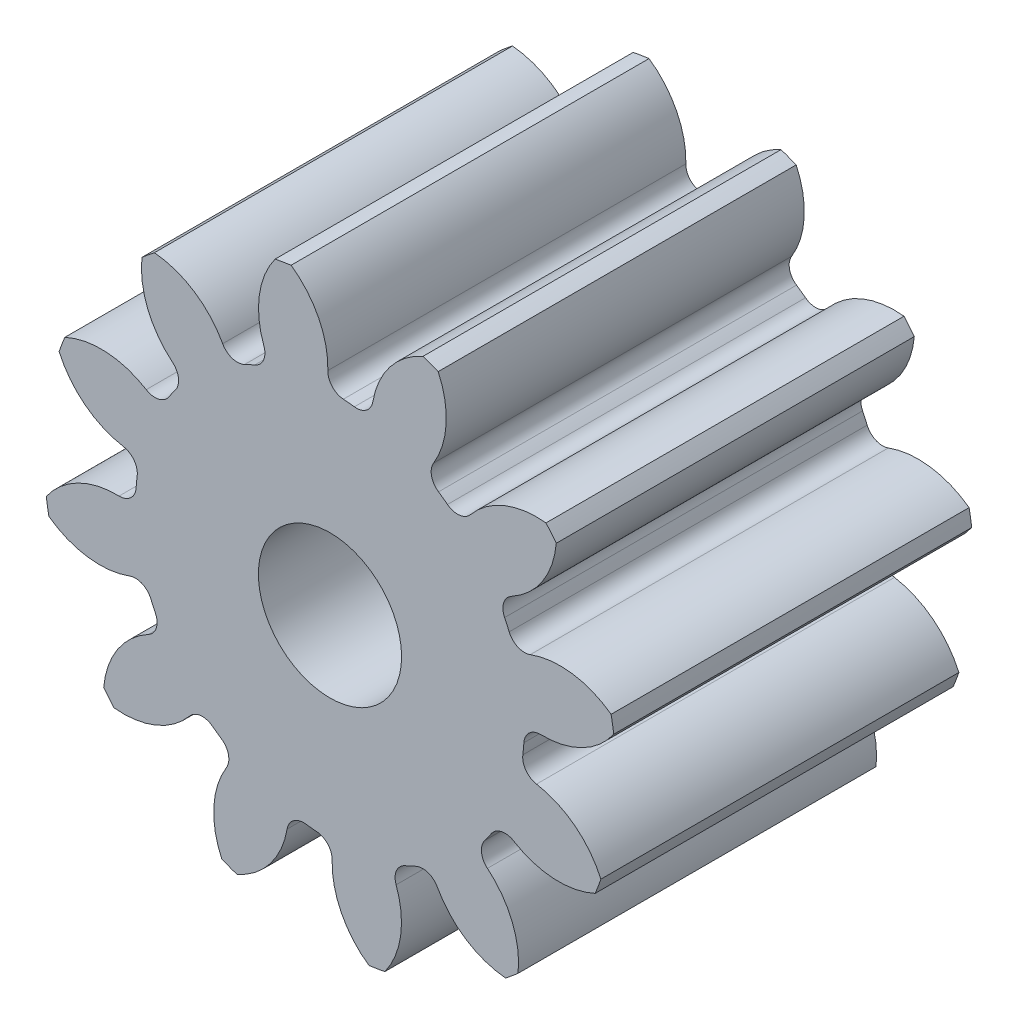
ISO-10303-21;
HEADER;
FILE_DESCRIPTION(('STEP AP214'),'2;1');
FILE_NAME('part.step','',(''),(''),'','','');
FILE_SCHEMA(('AUTOMOTIVE_DESIGN { 1 0 10303 214 1 1 1 1 }'));
ENDSEC;
DATA;
#1=APPLICATION_CONTEXT('core data for automotive mechanical design processes');
#2=APPLICATION_PROTOCOL_DEFINITION('international standard','automotive_design',2000,#1);
#3=PRODUCT_CONTEXT('',#1,'mechanical');
#4=PRODUCT('Part','Part','',(#3));
#5=PRODUCT_RELATED_PRODUCT_CATEGORY('part','',(#4));
#6=PRODUCT_DEFINITION_FORMATION('','',#4);
#7=PRODUCT_DEFINITION_CONTEXT('part definition',#1,'design');
#8=PRODUCT_DEFINITION('design','',#6,#7);
#9=PRODUCT_DEFINITION_SHAPE('','',#8);
#10=(LENGTH_UNIT() NAMED_UNIT(*) SI_UNIT(.MILLI.,.METRE.));
#11=(NAMED_UNIT(*) PLANE_ANGLE_UNIT() SI_UNIT($,.RADIAN.));
#12=(NAMED_UNIT(*) SI_UNIT($,.STERADIAN.) SOLID_ANGLE_UNIT());
#13=UNCERTAINTY_MEASURE_WITH_UNIT(LENGTH_MEASURE(1.E-05),#10,'distance_accuracy_value','');
#14=(GEOMETRIC_REPRESENTATION_CONTEXT(3) GLOBAL_UNCERTAINTY_ASSIGNED_CONTEXT((#13)) GLOBAL_UNIT_ASSIGNED_CONTEXT((#10,
#11,#12)) REPRESENTATION_CONTEXT('',''));
#15=CARTESIAN_POINT('',(0.,0.,0.));
#16=DIRECTION('',(0.,0.,1.));
#17=DIRECTION('',(1.,0.,0.));
#18=AXIS2_PLACEMENT_3D('',#15,#16,#17);
#19=CARTESIAN_POINT('',(0.,0.,88.9));
#20=DIRECTION('',(0.,0.,-1.));
#21=DIRECTION('',(-1.,0.,0.));
#22=AXIS2_PLACEMENT_3D('',#19,#20,#21);
#23=CYLINDRICAL_SURFACE('',#22,71.12);
#24=DIRECTION('',(0.,0.,-1.));
#25=VECTOR('',#24,1.);
#26=CARTESIAN_POINT('',(69.8031759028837,13.622445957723,44.45));
#27=LINE('',#26,#25);
#28=CARTESIAN_POINT('',(69.8031759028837,13.622445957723,88.9));
#29=VERTEX_POINT('',#28);
#30=CARTESIAN_POINT('',(69.8031759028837,13.622445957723,0.));
#31=VERTEX_POINT('',#30);
#32=EDGE_CURVE('E528',#29,#31,#27,.T.);
#33=ORIENTED_EDGE('',*,*,#32,.F.);
#34=CARTESIAN_POINT('',(0.,0.,88.9));
#35=DIRECTION('',(0.,0.,1.));
#36=DIRECTION('',(1.,0.,0.));
#37=AXIS2_PLACEMENT_3D('',#34,#35,#36);
#38=CIRCLE('',#37,71.12);
#39=CARTESIAN_POINT('',(70.4606797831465,9.66162535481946,88.9));
#40=VERTEX_POINT('',#39);
#41=EDGE_CURVE('E945',#40,#29,#38,.T.);
#42=ORIENTED_EDGE('',*,*,#41,.F.);
#43=DIRECTION('',(0.,0.,-1.));
#44=VECTOR('',#43,1.);
#45=CARTESIAN_POINT('',(70.4606797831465,9.66162535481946,44.45));
#46=LINE('',#45,#44);
#47=CARTESIAN_POINT('',(70.4606797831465,9.66162535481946,0.));
#48=VERTEX_POINT('',#47);
#49=EDGE_CURVE('E939',#48,#40,#46,.F.);
#50=ORIENTED_EDGE('',*,*,#49,.F.);
#51=CARTESIAN_POINT('',(0.,0.,0.));
#52=DIRECTION('',(0.,0.,1.));
#53=DIRECTION('',(1.,0.,0.));
#54=AXIS2_PLACEMENT_3D('',#51,#52,#53);
#55=CIRCLE('',#54,71.12);
#56=EDGE_CURVE('E950',#48,#31,#55,.T.);
#57=ORIENTED_EDGE('',*,*,#56,.T.);
#58=EDGE_LOOP('',(#33,#42,#50,#57));
#59=FACE_BOUND('',#58,.T.);
#60=ADVANCED_FACE('F33',(#59),#23,.T.);
#61=DIRECTION('',(0.,0.,-1.));
#62=VECTOR('',#61,1.);
#63=CARTESIAN_POINT('',(56.1899259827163,43.597552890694,44.45));
#64=LINE('',#63,#62);
#65=CARTESIAN_POINT('',(56.1899259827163,43.597552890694,0.));
#66=VERTEX_POINT('',#65);
#67=CARTESIAN_POINT('',(56.1899259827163,43.597552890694,88.9));
#68=VERTEX_POINT('',#67);
#69=EDGE_CURVE('E499',#66,#68,#64,.F.);
#70=ORIENTED_EDGE('',*,*,#69,.F.);
#71=CARTESIAN_POINT('',(53.6401006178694,46.6989722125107,0.));
#72=VERTEX_POINT('',#71);
#73=EDGE_CURVE('E953',#66,#72,#55,.T.);
#74=ORIENTED_EDGE('',*,*,#73,.T.);
#75=DIRECTION('',(0.,0.,-1.));
#76=VECTOR('',#75,1.);
#77=CARTESIAN_POINT('',(53.6401006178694,46.6989722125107,44.45));
#78=LINE('',#77,#76);
#79=CARTESIAN_POINT('',(53.6401006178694,46.6989722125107,88.9));
#80=VERTEX_POINT('',#79);
#81=EDGE_CURVE('E561',#80,#72,#78,.T.);
#82=ORIENTED_EDGE('',*,*,#81,.F.);
#83=EDGE_CURVE('E948',#68,#80,#38,.T.);
#84=ORIENTED_EDGE('',*,*,#83,.F.);
#85=EDGE_LOOP('',(#70,#74,#82,#84));
#86=FACE_BOUND('',#85,.T.);
#87=ADVANCED_FACE('F1091',(#86),#23,.T.);
#88=CARTESIAN_POINT('',(0.,0.,88.9));
#89=DIRECTION('',(0.,0.,1.));
#90=DIRECTION('',(1.,0.,0.));
#91=AXIS2_PLACEMENT_3D('',#88,#89,#90);
#92=PLANE('',#91);
#93=CARTESIAN_POINT('',(0.,0.,88.9000000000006));
#94=DIRECTION('',(0.,0.,1.));
#95=DIRECTION('',(1.,0.,0.));
#96=AXIS2_PLACEMENT_3D('',#93,#94,#95);
#97=CIRCLE('',#96,17.78);
#98=CARTESIAN_POINT('',(17.78,0.,88.9000000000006));
#99=VERTEX_POINT('',#98);
#100=EDGE_CURVE('E516',#99,#99,#97,.T.);
#101=ORIENTED_EDGE('',*,*,#100,.F.);
#102=EDGE_LOOP('',(#101));
#103=FACE_BOUND('',#102,.T.);
#104=ORIENTED_EDGE('',*,*,#41,.T.);
#105=CARTESIAN_POINT('',(57.1674985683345,-3.64623891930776,88.9));
#106=DIRECTION('',(0.,0.,-1.));
#107=DIRECTION('',(0.866025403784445,0.499999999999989,0.));
#108=AXIS2_PLACEMENT_3D('',#105,#106,#107);
#109=CIRCLE('',#108,21.3978461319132);
#110=CARTESIAN_POINT('',(49.7389070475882,16.4207450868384,88.9));
#111=VERTEX_POINT('',#110);
#112=EDGE_CURVE('E508',#111,#29,#109,.T.);
#113=ORIENTED_EDGE('',*,*,#112,.F.);
#114=CARTESIAN_POINT('',(48.3033365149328,20.2986768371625,88.9));
#115=DIRECTION('',(0.,0.,1.));
#116=DIRECTION('',(-0.866025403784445,-0.499999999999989,0.));
#117=AXIS2_PLACEMENT_3D('',#114,#115,#116);
#118=CIRCLE('',#117,4.13512);
#119=CARTESIAN_POINT('',(44.4911476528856,18.6966676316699,88.9));
#120=VERTEX_POINT('',#119);
#121=EDGE_CURVE('E506',#120,#111,#118,.T.);
#122=ORIENTED_EDGE('',*,*,#121,.F.);
#123=CARTESIAN_POINT('',(0.,0.,88.9));
#124=DIRECTION('',(0.,0.,-1.));
#125=DIRECTION('',(0.866025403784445,0.499999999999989,0.));
#126=AXIS2_PLACEMENT_3D('',#123,#124,#125);
#127=CIRCLE('',#126,48.26);
#128=CARTESIAN_POINT('',(43.3548256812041,21.1987426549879,88.9));
#129=VERTEX_POINT('',#128);
#130=EDGE_CURVE('E491',#129,#120,#127,.T.);
#131=ORIENTED_EDGE('',*,*,#130,.F.);
#132=CARTESIAN_POINT('',(47.0696496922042,23.015140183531,88.9));
#133=DIRECTION('',(0.,0.,1.));
#134=DIRECTION('',(-0.866025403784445,-0.499999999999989,0.));
#135=AXIS2_PLACEMENT_3D('',#132,#133,#134);
#136=CIRCLE('',#135,4.13512);
#137=CARTESIAN_POINT('',(45.0942271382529,26.6478971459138,88.9));
#138=VERTEX_POINT('',#137);
#139=EDGE_CURVE('E483',#138,#129,#136,.T.);
#140=ORIENTED_EDGE('',*,*,#139,.F.);
#141=CARTESIAN_POINT('',(34.8720841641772,45.4461846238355,88.9));
#142=DIRECTION('',(0.,0.,-1.));
#143=DIRECTION('',(-0.866025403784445,-0.499999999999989,0.));
#144=AXIS2_PLACEMENT_3D('',#141,#142,#143);
#145=CIRCLE('',#144,21.3978461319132);
#146=EDGE_CURVE('E513',#68,#138,#145,.T.);
#147=ORIENTED_EDGE('',*,*,#146,.F.);
#148=ORIENTED_EDGE('',*,*,#83,.T.);
#149=CARTESIAN_POINT('',(51.3316254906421,25.4260137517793,88.9));
#150=DIRECTION('',(0.,0.,-1.));
#151=DIRECTION('',(0.50000000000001,0.866025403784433,0.));
#152=AXIS2_PLACEMENT_3D('',#149,#150,#151);
#153=CIRCLE('',#152,21.3978461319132);
#154=CARTESIAN_POINT('',(34.864784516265,39.0902359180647,88.9));
#155=VERTEX_POINT('',#154);
#156=EDGE_CURVE('E537',#155,#80,#153,.T.);
#157=ORIENTED_EDGE('',*,*,#156,.F.);
#158=CARTESIAN_POINT('',(31.682578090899,41.7308380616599,88.9));
#159=DIRECTION('',(0.,0.,1.));
#160=DIRECTION('',(-0.50000000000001,-0.866025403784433,0.));
#161=AXIS2_PLACEMENT_3D('',#158,#159,#160);
#162=CIRCLE('',#161,4.13512);
#163=CARTESIAN_POINT('',(29.1821302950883,38.4373629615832,88.9));
#164=VERTEX_POINT('',#163);
#165=EDGE_CURVE('E535',#164,#155,#162,.T.);
#166=ORIENTED_EDGE('',*,*,#165,.F.);
#167=CARTESIAN_POINT('',(0.,0.,88.9));
#168=DIRECTION('',(0.,0.,-1.));
#169=DIRECTION('',(0.50000000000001,0.866025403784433,0.));
#170=AXIS2_PLACEMENT_3D('',#167,#168,#169);
#171=CIRCLE('',#170,48.26);
#172=CARTESIAN_POINT('',(26.9470090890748,40.0360625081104,88.9));
#173=VERTEX_POINT('',#172);
#174=EDGE_CURVE('E532',#173,#164,#171,.T.);
#175=ORIENTED_EDGE('',*,*,#174,.F.);
#176=CARTESIAN_POINT('',(29.2559422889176,43.4665209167,88.9));
#177=DIRECTION('',(0.,0.,1.));
#178=DIRECTION('',(-0.50000000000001,-0.866025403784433,0.));
#179=AXIS2_PLACEMENT_3D('',#176,#177,#178);
#180=CIRCLE('',#179,4.13512);
#181=CARTESIAN_POINT('',(25.7287976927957,45.6248694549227,88.9));
#182=VERTEX_POINT('',#181);
#183=EDGE_CURVE('E530',#182,#173,#180,.T.);
#184=ORIENTED_EDGE('',*,*,#183,.F.);
#185=CARTESIAN_POINT('',(7.47701845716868,56.7935924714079,88.9));
#186=DIRECTION('',(0.,0.,-1.));
#187=DIRECTION('',(-0.50000000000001,-0.866025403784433,0.));
#188=AXIS2_PLACEMENT_3D('',#185,#186,#187);
#189=CIRCLE('',#188,21.3978461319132);
#190=CARTESIAN_POINT('',(26.8631268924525,65.8515513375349,88.9));
#191=VERTEX_POINT('',#190);
#192=EDGE_CURVE('E540',#191,#182,#189,.T.);
#193=ORIENTED_EDGE('',*,*,#192,.F.);
#194=CARTESIAN_POINT('',(23.1042036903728,67.2625465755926,88.9));
#195=VERTEX_POINT('',#194);
#196=EDGE_CURVE('E985',#191,#195,#38,.T.);
#197=ORIENTED_EDGE('',*,*,#196,.T.);
#198=CARTESIAN_POINT('',(31.7414848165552,47.6853865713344,88.9));
#199=DIRECTION('',(0.,0.,-1.));
#200=DIRECTION('',(0.,1.,0.));
#201=AXIS2_PLACEMENT_3D('',#198,#199,#200);
#202=CIRCLE('',#201,21.3978461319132);
#203=CARTESIAN_POINT('',(10.6486711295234,51.2855296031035,88.9));
#204=VERTEX_POINT('',#203);
#205=EDGE_CURVE('E572',#204,#195,#202,.T.);
#206=ORIENTED_EDGE('',*,*,#205,.F.);
#207=CARTESIAN_POINT('',(6.57249845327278,51.9812549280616,88.9));
#208=DIRECTION('',(0.,0.,1.));
#209=DIRECTION('',(0.,-1.,0.));
#210=AXIS2_PLACEMENT_3D('',#207,#208,#209);
#211=CIRCLE('',#210,4.13512);
#212=CARTESIAN_POINT('',(6.05378469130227,47.8787979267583,88.9));
#213=VERTEX_POINT('',#212);
#214=EDGE_CURVE('E570',#213,#204,#211,.T.);
#215=ORIENTED_EDGE('',*,*,#214,.F.);
#216=CARTESIAN_POINT('',(0.,0.,88.9));
#217=DIRECTION('',(0.,0.,-1.));
#218=DIRECTION('',(0.,1.,0.));
#219=AXIS2_PLACEMENT_3D('',#216,#217,#218);
#220=CIRCLE('',#219,48.26);
#221=CARTESIAN_POINT('',(3.31876317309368,48.1457517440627,88.9));
#222=VERTEX_POINT('',#221);
#223=EDGE_CURVE('E567',#222,#213,#220,.T.);
#224=ORIENTED_EDGE('',*,*,#223,.F.);
#225=CARTESIAN_POINT('',(3.60312877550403,52.2710824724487,88.9));
#226=DIRECTION('',(0.,0.,1.));
#227=DIRECTION('',(0.,-1.,0.));
#228=AXIS2_PLACEMENT_3D('',#225,#226,#227);
#229=CIRCLE('',#228,4.13512);
#230=CARTESIAN_POINT('',(-0.530642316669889,52.3766948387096,88.9));
#231=VERTEX_POINT('',#230);
#232=EDGE_CURVE('E565',#231,#222,#229,.T.);
#233=ORIENTED_EDGE('',*,*,#232,.F.);
#234=CARTESIAN_POINT('',(-21.9215083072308,52.9232030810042,88.9));
#235=DIRECTION('',(0.,0.,-1.));
#236=DIRECTION('',(0.,-1.,0.));
#237=AXIS2_PLACEMENT_3D('',#234,#235,#236);
#238=CIRCLE('',#237,21.3978461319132);
#239=CARTESIAN_POINT('',(-9.66162535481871,70.4606797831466,88.9));
#240=VERTEX_POINT('',#239);
#241=EDGE_CURVE('E575',#240,#231,#238,.T.);
#242=ORIENTED_EDGE('',*,*,#241,.F.);
#243=CARTESIAN_POINT('',(-13.6224459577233,69.8031759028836,88.9));
#244=VERTEX_POINT('',#243);
#245=EDGE_CURVE('E1073',#240,#244,#38,.T.);
#246=ORIENTED_EDGE('',*,*,#245,.T.);
#247=CARTESIAN_POINT('',(3.64623891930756,57.1674985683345,88.9));
#248=DIRECTION('',(0.,0.,-1.));
#249=DIRECTION('',(-0.499999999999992,0.866025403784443,0.));
#250=AXIS2_PLACEMENT_3D('',#247,#248,#249);
#251=CIRCLE('',#250,21.3978461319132);
#252=CARTESIAN_POINT('',(-16.4207450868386,49.7389070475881,88.9));
#253=VERTEX_POINT('',#252);
#254=EDGE_CURVE('E610',#253,#244,#251,.T.);
#255=ORIENTED_EDGE('',*,*,#254,.F.);
#256=CARTESIAN_POINT('',(-20.2986768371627,48.3033365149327,88.9));
#257=DIRECTION('',(0.,0.,1.));
#258=DIRECTION('',(0.499999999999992,-0.866025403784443,0.));
#259=AXIS2_PLACEMENT_3D('',#256,#257,#258);
#260=CIRCLE('',#259,4.13512);
#261=CARTESIAN_POINT('',(-18.6966676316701,44.4911476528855,88.9));
#262=VERTEX_POINT('',#261);
#263=EDGE_CURVE('E608',#262,#253,#260,.T.);
#264=ORIENTED_EDGE('',*,*,#263,.F.);
#265=CARTESIAN_POINT('',(0.,0.,88.9));
#266=DIRECTION('',(0.,0.,-1.));
#267=DIRECTION('',(-0.499999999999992,0.866025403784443,0.));
#268=AXIS2_PLACEMENT_3D('',#265,#266,#267);
#269=CIRCLE('',#268,48.26);
#270=CARTESIAN_POINT('',(-21.198742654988,43.354825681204,88.9));
#271=VERTEX_POINT('',#270);
#272=EDGE_CURVE('E605',#271,#262,#269,.T.);
#273=ORIENTED_EDGE('',*,*,#272,.F.);
#274=CARTESIAN_POINT('',(-23.0151401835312,47.0696496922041,88.9));
#275=DIRECTION('',(0.,0.,1.));
#276=DIRECTION('',(0.499999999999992,-0.866025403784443,0.));
#277=AXIS2_PLACEMENT_3D('',#274,#275,#276);
#278=CIRCLE('',#277,4.13512);
#279=CARTESIAN_POINT('',(-26.647897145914,45.0942271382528,88.9));
#280=VERTEX_POINT('',#279);
#281=EDGE_CURVE('E603',#280,#271,#278,.T.);
#282=ORIENTED_EDGE('',*,*,#281,.F.);
#283=CARTESIAN_POINT('',(-45.4461846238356,34.8720841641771,88.9));
#284=DIRECTION('',(0.,0.,-1.));
#285=DIRECTION('',(0.499999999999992,-0.866025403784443,0.));
#286=AXIS2_PLACEMENT_3D('',#283,#284,#285);
#287=CIRCLE('',#286,21.3978461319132);
#288=CARTESIAN_POINT('',(-43.5975528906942,56.1899259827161,88.9));
#289=VERTEX_POINT('',#288);
#290=EDGE_CURVE('E613',#289,#280,#287,.T.);
#291=ORIENTED_EDGE('',*,*,#290,.F.);
#292=CARTESIAN_POINT('',(-46.6989722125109,53.6401006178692,88.9));
#293=VERTEX_POINT('',#292);
#294=EDGE_CURVE('E1069',#289,#293,#38,.T.);
#295=ORIENTED_EDGE('',*,*,#294,.T.);
#296=CARTESIAN_POINT('',(-25.4260137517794,51.331625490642,88.9));
#297=DIRECTION('',(0.,0.,-1.));
#298=DIRECTION('',(-0.866025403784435,0.500000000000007,0.));
#299=AXIS2_PLACEMENT_3D('',#296,#297,#298);
#300=CIRCLE('',#299,21.3978461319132);
#301=CARTESIAN_POINT('',(-39.0902359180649,34.8647845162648,88.9));
#302=VERTEX_POINT('',#301);
#303=EDGE_CURVE('E648',#302,#293,#300,.T.);
#304=ORIENTED_EDGE('',*,*,#303,.F.);
#305=CARTESIAN_POINT('',(-41.7308380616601,31.6825780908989,88.9));
#306=DIRECTION('',(0.,0.,1.));
#307=DIRECTION('',(0.866025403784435,-0.500000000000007,0.));
#308=AXIS2_PLACEMENT_3D('',#305,#306,#307);
#309=CIRCLE('',#308,4.13512);
#310=CARTESIAN_POINT('',(-38.4373629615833,29.1821302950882,88.9));
#311=VERTEX_POINT('',#310);
#312=EDGE_CURVE('E646',#311,#302,#309,.T.);
#313=ORIENTED_EDGE('',*,*,#312,.F.);
#314=CARTESIAN_POINT('',(0.,0.,88.9));
#315=DIRECTION('',(0.,0.,-1.));
#316=DIRECTION('',(-0.866025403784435,0.500000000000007,0.));
#317=AXIS2_PLACEMENT_3D('',#314,#315,#316);
#318=CIRCLE('',#317,48.26);
#319=CARTESIAN_POINT('',(-40.0360625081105,26.9470090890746,88.9));
#320=VERTEX_POINT('',#319);
#321=EDGE_CURVE('E643',#320,#311,#318,.T.);
#322=ORIENTED_EDGE('',*,*,#321,.F.);
#323=CARTESIAN_POINT('',(-43.4665209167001,29.2559422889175,88.9));
#324=DIRECTION('',(0.,0.,1.));
#325=DIRECTION('',(0.866025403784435,-0.500000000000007,0.));
#326=AXIS2_PLACEMENT_3D('',#323,#324,#325);
#327=CIRCLE('',#326,4.13512);
#328=CARTESIAN_POINT('',(-45.6248694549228,25.7287976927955,88.9));
#329=VERTEX_POINT('',#328);
#330=EDGE_CURVE('E641',#329,#320,#327,.T.);
#331=ORIENTED_EDGE('',*,*,#330,.F.);
#332=CARTESIAN_POINT('',(-56.7935924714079,7.47701845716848,88.9));
#333=DIRECTION('',(0.,0.,-1.));
#334=DIRECTION('',(0.866025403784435,-0.500000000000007,0.));
#335=AXIS2_PLACEMENT_3D('',#332,#333,#334);
#336=CIRCLE('',#335,21.3978461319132);
#337=CARTESIAN_POINT('',(-65.851551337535,26.8631268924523,88.9));
#338=VERTEX_POINT('',#337);
#339=EDGE_CURVE('E651',#338,#329,#336,.T.);
#340=ORIENTED_EDGE('',*,*,#339,.F.);
#341=CARTESIAN_POINT('',(-67.2625465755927,23.1042036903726,88.9));
#342=VERTEX_POINT('',#341);
#343=EDGE_CURVE('E1065',#338,#342,#38,.T.);
#344=ORIENTED_EDGE('',*,*,#343,.T.);
#345=CARTESIAN_POINT('',(-47.6853865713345,31.741484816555,88.9));
#346=DIRECTION('',(0.,0.,-1.));
#347=DIRECTION('',(-1.,0.,0.));
#348=AXIS2_PLACEMENT_3D('',#345,#346,#347);
#349=CIRCLE('',#348,21.3978461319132);
#350=CARTESIAN_POINT('',(-51.2855296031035,10.6486711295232,88.9));
#351=VERTEX_POINT('',#350);
#352=EDGE_CURVE('E686',#351,#342,#349,.T.);
#353=ORIENTED_EDGE('',*,*,#352,.F.);
#354=CARTESIAN_POINT('',(-51.9812549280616,6.5724984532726,88.9));
#355=DIRECTION('',(0.,0.,1.));
#356=DIRECTION('',(1.,0.,0.));
#357=AXIS2_PLACEMENT_3D('',#354,#355,#356);
#358=CIRCLE('',#357,4.13512);
#359=CARTESIAN_POINT('',(-47.8787979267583,6.0537846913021,88.9));
#360=VERTEX_POINT('',#359);
#361=EDGE_CURVE('E684',#360,#351,#358,.T.);
#362=ORIENTED_EDGE('',*,*,#361,.F.);
#363=CARTESIAN_POINT('',(0.,0.,88.9));
#364=DIRECTION('',(0.,0.,-1.));
#365=DIRECTION('',(-1.,0.,0.));
#366=AXIS2_PLACEMENT_3D('',#363,#364,#365);
#367=CIRCLE('',#366,48.26);
#368=CARTESIAN_POINT('',(-48.1457517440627,3.31876317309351,88.9));
#369=VERTEX_POINT('',#368);
#370=EDGE_CURVE('E681',#369,#360,#367,.T.);
#371=ORIENTED_EDGE('',*,*,#370,.F.);
#372=CARTESIAN_POINT('',(-52.2710824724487,3.60312877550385,88.9));
#373=DIRECTION('',(0.,0.,1.));
#374=DIRECTION('',(1.,0.,0.));
#375=AXIS2_PLACEMENT_3D('',#372,#373,#374);
#376=CIRCLE('',#375,4.13512);
#377=CARTESIAN_POINT('',(-52.3766948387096,-0.530642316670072,88.9));
#378=VERTEX_POINT('',#377);
#379=EDGE_CURVE('E679',#378,#369,#376,.T.);
#380=ORIENTED_EDGE('',*,*,#379,.F.);
#381=CARTESIAN_POINT('',(-52.9232030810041,-21.921508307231,88.9));
#382=DIRECTION('',(0.,0.,-1.));
#383=DIRECTION('',(1.,0.,0.));
#384=AXIS2_PLACEMENT_3D('',#381,#382,#383);
#385=CIRCLE('',#384,21.3978461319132);
#386=CARTESIAN_POINT('',(-70.4606797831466,-9.66162535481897,88.9));
#387=VERTEX_POINT('',#386);
#388=EDGE_CURVE('E689',#387,#378,#385,.T.);
#389=ORIENTED_EDGE('',*,*,#388,.F.);
#390=CARTESIAN_POINT('',(-69.8031759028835,-13.6224459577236,88.9));
#391=VERTEX_POINT('',#390);
#392=EDGE_CURVE('E1061',#387,#391,#38,.T.);
#393=ORIENTED_EDGE('',*,*,#392,.T.);
#394=CARTESIAN_POINT('',(-57.1674985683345,3.64623891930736,88.9));
#395=DIRECTION('',(0.,0.,-1.));
#396=DIRECTION('',(-0.866025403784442,-0.499999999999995,0.));
#397=AXIS2_PLACEMENT_3D('',#394,#395,#396);
#398=CIRCLE('',#397,21.3978461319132);
#399=CARTESIAN_POINT('',(-49.7389070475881,-16.4207450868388,88.9));
#400=VERTEX_POINT('',#399);
#401=EDGE_CURVE('E724',#400,#391,#398,.T.);
#402=ORIENTED_EDGE('',*,*,#401,.F.);
#403=CARTESIAN_POINT('',(-48.3033365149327,-20.2986768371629,88.9));
#404=DIRECTION('',(0.,0.,1.));
#405=DIRECTION('',(0.866025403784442,0.499999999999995,0.));
#406=AXIS2_PLACEMENT_3D('',#403,#404,#405);
#407=CIRCLE('',#406,4.13512);
#408=CARTESIAN_POINT('',(-44.4911476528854,-18.6966676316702,88.9));
#409=VERTEX_POINT('',#408);
#410=EDGE_CURVE('E722',#409,#400,#407,.T.);
#411=ORIENTED_EDGE('',*,*,#410,.F.);
#412=CARTESIAN_POINT('',(0.,0.,88.9));
#413=DIRECTION('',(0.,0.,-1.));
#414=DIRECTION('',(-0.866025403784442,-0.499999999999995,0.));
#415=AXIS2_PLACEMENT_3D('',#412,#413,#414);
#416=CIRCLE('',#415,48.26);
#417=CARTESIAN_POINT('',(-43.354825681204,-21.1987426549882,88.9));
#418=VERTEX_POINT('',#417);
#419=EDGE_CURVE('E719',#418,#409,#416,.T.);
#420=ORIENTED_EDGE('',*,*,#419,.F.);
#421=CARTESIAN_POINT('',(-47.069649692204,-23.0151401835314,88.9));
#422=DIRECTION('',(0.,0.,1.));
#423=DIRECTION('',(0.866025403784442,0.499999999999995,0.));
#424=AXIS2_PLACEMENT_3D('',#421,#422,#423);
#425=CIRCLE('',#424,4.13512);
#426=CARTESIAN_POINT('',(-45.0942271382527,-26.6478971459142,88.9));
#427=VERTEX_POINT('',#426);
#428=EDGE_CURVE('E717',#427,#418,#425,.T.);
#429=ORIENTED_EDGE('',*,*,#428,.F.);
#430=CARTESIAN_POINT('',(-34.8720841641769,-45.4461846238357,88.9));
#431=DIRECTION('',(0.,0.,-1.));
#432=DIRECTION('',(0.866025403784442,0.499999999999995,0.));
#433=AXIS2_PLACEMENT_3D('',#430,#431,#432);
#434=CIRCLE('',#433,21.3978461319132);
#435=CARTESIAN_POINT('',(-56.189925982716,-43.5975528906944,88.9));
#436=VERTEX_POINT('',#435);
#437=EDGE_CURVE('E727',#436,#427,#434,.T.);
#438=ORIENTED_EDGE('',*,*,#437,.F.);
#439=CARTESIAN_POINT('',(-53.6401006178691,-46.6989722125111,88.9));
#440=VERTEX_POINT('',#439);
#441=EDGE_CURVE('E1057',#436,#440,#38,.T.);
#442=ORIENTED_EDGE('',*,*,#441,.T.);
#443=CARTESIAN_POINT('',(-51.3316254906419,-25.4260137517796,88.9));
#444=DIRECTION('',(0.,0.,-1.));
#445=DIRECTION('',(-0.500000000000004,-0.866025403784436,0.));
#446=AXIS2_PLACEMENT_3D('',#443,#444,#445);
#447=CIRCLE('',#446,21.3978461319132);
#448=CARTESIAN_POINT('',(-34.8647845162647,-39.090235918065,88.9));
#449=VERTEX_POINT('',#448);
#450=EDGE_CURVE('E762',#449,#440,#447,.T.);
#451=ORIENTED_EDGE('',*,*,#450,.F.);
#452=CARTESIAN_POINT('',(-31.6825780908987,-41.7308380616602,88.9));
#453=DIRECTION('',(0.,0.,1.));
#454=DIRECTION('',(0.500000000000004,0.866025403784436,0.));
#455=AXIS2_PLACEMENT_3D('',#452,#453,#454);
#456=CIRCLE('',#455,4.13512);
#457=CARTESIAN_POINT('',(-29.182130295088,-38.4373629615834,88.9));
#458=VERTEX_POINT('',#457);
#459=EDGE_CURVE('E760',#458,#449,#456,.T.);
#460=ORIENTED_EDGE('',*,*,#459,.F.);
#461=CARTESIAN_POINT('',(0.,0.,88.9));
#462=DIRECTION('',(0.,0.,-1.));
#463=DIRECTION('',(-0.500000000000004,-0.866025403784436,0.));
#464=AXIS2_PLACEMENT_3D('',#461,#462,#463);
#465=CIRCLE('',#464,48.26);
#466=CARTESIAN_POINT('',(-26.9470090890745,-40.0360625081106,88.9));
#467=VERTEX_POINT('',#466);
#468=EDGE_CURVE('E757',#467,#458,#465,.T.);
#469=ORIENTED_EDGE('',*,*,#468,.F.);
#470=CARTESIAN_POINT('',(-29.2559422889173,-43.4665209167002,88.9));
#471=DIRECTION('',(0.,0.,1.));
#472=DIRECTION('',(0.500000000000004,0.866025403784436,0.));
#473=AXIS2_PLACEMENT_3D('',#470,#471,#472);
#474=CIRCLE('',#473,4.13512);
#475=CARTESIAN_POINT('',(-25.7287976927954,-45.6248694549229,88.9));
#476=VERTEX_POINT('',#475);
#477=EDGE_CURVE('E755',#476,#467,#474,.T.);
#478=ORIENTED_EDGE('',*,*,#477,.F.);
#479=CARTESIAN_POINT('',(-7.47701845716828,-56.793592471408,88.9));
#480=DIRECTION('',(0.,0.,-1.));
#481=DIRECTION('',(0.500000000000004,0.866025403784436,0.));
#482=AXIS2_PLACEMENT_3D('',#479,#480,#481);
#483=CIRCLE('',#482,21.3978461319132);
#484=CARTESIAN_POINT('',(-26.8631268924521,-65.8515513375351,88.9));
#485=VERTEX_POINT('',#484);
#486=EDGE_CURVE('E765',#485,#476,#483,.T.);
#487=ORIENTED_EDGE('',*,*,#486,.F.);
#488=CARTESIAN_POINT('',(-23.1042036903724,-67.2625465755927,88.9));
#489=VERTEX_POINT('',#488);
#490=EDGE_CURVE('E1053',#485,#489,#38,.T.);
#491=ORIENTED_EDGE('',*,*,#490,.T.);
#492=CARTESIAN_POINT('',(-31.7414848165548,-47.6853865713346,88.9));
#493=DIRECTION('',(0.,0.,-1.));
#494=DIRECTION('',(0.,-1.,0.));
#495=AXIS2_PLACEMENT_3D('',#492,#493,#494);
#496=CIRCLE('',#495,21.3978461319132);
#497=CARTESIAN_POINT('',(-10.648671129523,-51.2855296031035,88.9));
#498=VERTEX_POINT('',#497);
#499=EDGE_CURVE('E800',#498,#489,#496,.T.);
#500=ORIENTED_EDGE('',*,*,#499,.F.);
#501=CARTESIAN_POINT('',(-6.57249845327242,-51.9812549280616,88.9));
#502=DIRECTION('',(0.,0.,1.));
#503=DIRECTION('',(0.,1.,0.));
#504=AXIS2_PLACEMENT_3D('',#501,#502,#503);
#505=CIRCLE('',#504,4.13512);
#506=CARTESIAN_POINT('',(-6.05378469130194,-47.8787979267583,88.9));
#507=VERTEX_POINT('',#506);
#508=EDGE_CURVE('E798',#507,#498,#505,.T.);
#509=ORIENTED_EDGE('',*,*,#508,.F.);
#510=CARTESIAN_POINT('',(0.,0.,88.9));
#511=DIRECTION('',(0.,0.,-1.));
#512=DIRECTION('',(0.,-1.,0.));
#513=AXIS2_PLACEMENT_3D('',#510,#511,#512);
#514=CIRCLE('',#513,48.26);
#515=CARTESIAN_POINT('',(-3.31876317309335,-48.1457517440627,88.9));
#516=VERTEX_POINT('',#515);
#517=EDGE_CURVE('E795',#516,#507,#514,.T.);
#518=ORIENTED_EDGE('',*,*,#517,.F.);
#519=CARTESIAN_POINT('',(-3.60312877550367,-52.2710824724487,88.9));
#520=DIRECTION('',(0.,0.,1.));
#521=DIRECTION('',(0.,1.,0.));
#522=AXIS2_PLACEMENT_3D('',#519,#520,#521);
#523=CIRCLE('',#522,4.13512);
#524=CARTESIAN_POINT('',(0.530642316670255,-52.3766948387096,88.9));
#525=VERTEX_POINT('',#524);
#526=EDGE_CURVE('E793',#525,#516,#523,.T.);
#527=ORIENTED_EDGE('',*,*,#526,.F.);
#528=CARTESIAN_POINT('',(21.9215083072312,-52.923203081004,88.9));
#529=DIRECTION('',(0.,0.,-1.));
#530=DIRECTION('',(0.,1.,0.));
#531=AXIS2_PLACEMENT_3D('',#528,#529,#530);
#532=CIRCLE('',#531,21.3978461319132);
#533=CARTESIAN_POINT('',(9.66162535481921,-70.4606797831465,88.9));
#534=VERTEX_POINT('',#533);
#535=EDGE_CURVE('E803',#534,#525,#532,.T.);
#536=ORIENTED_EDGE('',*,*,#535,.F.);
#537=CARTESIAN_POINT('',(13.6224459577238,-69.8031759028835,88.9));
#538=VERTEX_POINT('',#537);
#539=EDGE_CURVE('E1049',#534,#538,#38,.T.);
#540=ORIENTED_EDGE('',*,*,#539,.T.);
#541=CARTESIAN_POINT('',(-3.64623891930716,-57.1674985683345,88.9));
#542=DIRECTION('',(0.,0.,-1.));
#543=DIRECTION('',(0.499999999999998,-0.86602540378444,0.));
#544=AXIS2_PLACEMENT_3D('',#541,#542,#543);
#545=CIRCLE('',#544,21.3978461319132);
#546=CARTESIAN_POINT('',(16.420745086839,-49.738907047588,88.9));
#547=VERTEX_POINT('',#546);
#548=EDGE_CURVE('E838',#547,#538,#545,.T.);
#549=ORIENTED_EDGE('',*,*,#548,.F.);
#550=CARTESIAN_POINT('',(20.298676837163,-48.3033365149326,88.9));
#551=DIRECTION('',(0.,0.,1.));
#552=DIRECTION('',(-0.499999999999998,0.86602540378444,0.));
#553=AXIS2_PLACEMENT_3D('',#550,#551,#552);
#554=CIRCLE('',#553,4.13512);
#555=CARTESIAN_POINT('',(18.6966676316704,-44.4911476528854,88.9));
#556=VERTEX_POINT('',#555);
#557=EDGE_CURVE('E836',#556,#547,#554,.T.);
#558=ORIENTED_EDGE('',*,*,#557,.F.);
#559=CARTESIAN_POINT('',(0.,0.,88.9));
#560=DIRECTION('',(0.,0.,-1.));
#561=DIRECTION('',(0.499999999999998,-0.86602540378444,0.));
#562=AXIS2_PLACEMENT_3D('',#559,#560,#561);
#563=CIRCLE('',#562,48.26);
#564=CARTESIAN_POINT('',(21.1987426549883,-43.3548256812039,88.9));
#565=VERTEX_POINT('',#564);
#566=EDGE_CURVE('E833',#565,#556,#563,.T.);
#567=ORIENTED_EDGE('',*,*,#566,.F.);
#568=CARTESIAN_POINT('',(23.0151401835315,-47.0696496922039,88.9));
#569=DIRECTION('',(0.,0.,1.));
#570=DIRECTION('',(-0.499999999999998,0.86602540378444,0.));
#571=AXIS2_PLACEMENT_3D('',#568,#569,#570);
#572=CIRCLE('',#571,4.13512);
#573=CARTESIAN_POINT('',(26.6478971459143,-45.0942271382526,88.9));
#574=VERTEX_POINT('',#573);
#575=EDGE_CURVE('E831',#574,#565,#572,.T.);
#576=ORIENTED_EDGE('',*,*,#575,.F.);
#577=CARTESIAN_POINT('',(45.4461846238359,-34.8720841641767,88.9));
#578=DIRECTION('',(0.,0.,-1.));
#579=DIRECTION('',(-0.499999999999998,0.86602540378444,0.));
#580=AXIS2_PLACEMENT_3D('',#577,#578,#579);
#581=CIRCLE('',#580,21.3978461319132);
#582=CARTESIAN_POINT('',(43.5975528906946,-56.1899259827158,88.9));
#583=VERTEX_POINT('',#582);
#584=EDGE_CURVE('E841',#583,#574,#581,.T.);
#585=ORIENTED_EDGE('',*,*,#584,.F.);
#586=CARTESIAN_POINT('',(46.6989722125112,-53.6401006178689,88.9));
#587=VERTEX_POINT('',#586);
#588=EDGE_CURVE('E1048',#583,#587,#38,.T.);
#589=ORIENTED_EDGE('',*,*,#588,.T.);
#590=CARTESIAN_POINT('',(25.4260137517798,-51.3316254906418,88.9));
#591=DIRECTION('',(0.,0.,-1.));
#592=DIRECTION('',(0.866025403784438,-0.500000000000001,0.));
#593=AXIS2_PLACEMENT_3D('',#590,#591,#592);
#594=CIRCLE('',#593,21.3978461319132);
#595=CARTESIAN_POINT('',(39.0902359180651,-34.8647845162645,88.9));
#596=VERTEX_POINT('',#595);
#597=EDGE_CURVE('E876',#596,#587,#594,.T.);
#598=ORIENTED_EDGE('',*,*,#597,.F.);
#599=CARTESIAN_POINT('',(41.7308380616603,-31.6825780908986,88.9));
#600=DIRECTION('',(0.,0.,1.));
#601=DIRECTION('',(-0.866025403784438,0.500000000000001,0.));
#602=AXIS2_PLACEMENT_3D('',#599,#600,#601);
#603=CIRCLE('',#602,4.13512);
#604=CARTESIAN_POINT('',(38.4373629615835,-29.1821302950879,88.9));
#605=VERTEX_POINT('',#604);
#606=EDGE_CURVE('E874',#605,#596,#603,.T.);
#607=ORIENTED_EDGE('',*,*,#606,.F.);
#608=CARTESIAN_POINT('',(0.,0.,88.9));
#609=DIRECTION('',(0.,0.,-1.));
#610=DIRECTION('',(0.866025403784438,-0.500000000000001,0.));
#611=AXIS2_PLACEMENT_3D('',#608,#609,#610);
#612=CIRCLE('',#611,48.26);
#613=CARTESIAN_POINT('',(40.0360625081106,-26.9470090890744,88.9));
#614=VERTEX_POINT('',#613);
#615=EDGE_CURVE('E871',#614,#605,#612,.T.);
#616=ORIENTED_EDGE('',*,*,#615,.F.);
#617=CARTESIAN_POINT('',(43.4665209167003,-29.2559422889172,88.9));
#618=DIRECTION('',(0.,0.,1.));
#619=DIRECTION('',(-0.866025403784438,0.500000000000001,0.));
#620=AXIS2_PLACEMENT_3D('',#617,#618,#619);
#621=CIRCLE('',#620,4.13512);
#622=CARTESIAN_POINT('',(45.624869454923,-25.7287976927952,88.9));
#623=VERTEX_POINT('',#622);
#624=EDGE_CURVE('E869',#623,#614,#621,.T.);
#625=ORIENTED_EDGE('',*,*,#624,.F.);
#626=CARTESIAN_POINT('',(56.793592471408,-7.47701845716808,88.9));
#627=DIRECTION('',(0.,0.,-1.));
#628=DIRECTION('',(-0.866025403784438,0.500000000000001,0.));
#629=AXIS2_PLACEMENT_3D('',#626,#627,#628);
#630=CIRCLE('',#629,21.3978461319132);
#631=CARTESIAN_POINT('',(65.8515513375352,-26.8631268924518,88.9));
#632=VERTEX_POINT('',#631);
#633=EDGE_CURVE('E879',#632,#623,#630,.T.);
#634=ORIENTED_EDGE('',*,*,#633,.F.);
#635=CARTESIAN_POINT('',(67.2625465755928,-23.1042036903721,88.9));
#636=VERTEX_POINT('',#635);
#637=EDGE_CURVE('E949',#632,#636,#38,.T.);
#638=ORIENTED_EDGE('',*,*,#637,.T.);
#639=CARTESIAN_POINT('',(47.6853865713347,-31.7414848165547,88.9));
#640=DIRECTION('',(0.,0.,-1.));
#641=DIRECTION('',(1.,0.,0.));
#642=AXIS2_PLACEMENT_3D('',#639,#640,#641);
#643=CIRCLE('',#642,21.3978461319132);
#644=CARTESIAN_POINT('',(51.2855296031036,-10.6486711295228,88.9));
#645=VERTEX_POINT('',#644);
#646=EDGE_CURVE('E914',#645,#636,#643,.T.);
#647=ORIENTED_EDGE('',*,*,#646,.F.);
#648=CARTESIAN_POINT('',(51.9812549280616,-6.57249845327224,88.9));
#649=DIRECTION('',(0.,0.,1.));
#650=DIRECTION('',(-1.,0.,0.));
#651=AXIS2_PLACEMENT_3D('',#648,#649,#650);
#652=CIRCLE('',#651,4.13512);
#653=CARTESIAN_POINT('',(47.8787979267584,-6.05378469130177,88.9));
#654=VERTEX_POINT('',#653);
#655=EDGE_CURVE('E912',#654,#645,#652,.T.);
#656=ORIENTED_EDGE('',*,*,#655,.F.);
#657=CARTESIAN_POINT('',(0.,0.,88.9));
#658=DIRECTION('',(0.,0.,-1.));
#659=DIRECTION('',(1.,0.,0.));
#660=AXIS2_PLACEMENT_3D('',#657,#658,#659);
#661=CIRCLE('',#660,48.26);
#662=CARTESIAN_POINT('',(48.1457517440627,-3.31876317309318,88.9));
#663=VERTEX_POINT('',#662);
#664=EDGE_CURVE('E909',#663,#654,#661,.T.);
#665=ORIENTED_EDGE('',*,*,#664,.F.);
#666=CARTESIAN_POINT('',(52.2710824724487,-3.60312877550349,88.9));
#667=DIRECTION('',(0.,0.,1.));
#668=DIRECTION('',(-1.,0.,0.));
#669=AXIS2_PLACEMENT_3D('',#666,#667,#668);
#670=CIRCLE('',#669,4.13512);
#671=CARTESIAN_POINT('',(52.3766948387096,0.530642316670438,88.9));
#672=VERTEX_POINT('',#671);
#673=EDGE_CURVE('E907',#672,#663,#670,.T.);
#674=ORIENTED_EDGE('',*,*,#673,.F.);
#675=CARTESIAN_POINT('',(52.923203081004,21.9215083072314,88.9));
#676=DIRECTION('',(0.,0.,-1.));
#677=DIRECTION('',(-1.,0.,0.));
#678=AXIS2_PLACEMENT_3D('',#675,#676,#677);
#679=CIRCLE('',#678,21.3978461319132);
#680=EDGE_CURVE('E917',#40,#672,#679,.T.);
#681=ORIENTED_EDGE('',*,*,#680,.F.);
#682=EDGE_LOOP('',(#104,#113,#122,#131,#140,#147,#148,#157,#166,#175,#184,#193,#197,#206,#215,
#224,#233,#242,#246,#255,#264,#273,#282,#291,#295,#304,#313,#322,#331,#340,#344,#353,#362,#371,
#380,#389,#393,#402,#411,#420,#429,#438,#442,#451,#460,#469,#478,#487,#491,#500,#509,#518,#527,
#536,#540,#549,#558,#567,#576,#585,#589,#598,#607,#616,#625,#634,#638,#647,#656,#665,#674,#681));
#683=FACE_BOUND('',#682,.T.);
#684=ADVANCED_FACE('F504',(#103,#683),#92,.T.);
#685=CARTESIAN_POINT('',(0.,0.,0.));
#686=DIRECTION('',(0.,0.,1.));
#687=DIRECTION('',(1.,0.,0.));
#688=AXIS2_PLACEMENT_3D('',#685,#686,#687);
#689=PLANE('',#688);
#690=CARTESIAN_POINT('',(0.,0.,0.));
#691=DIRECTION('',(0.,0.,1.));
#692=DIRECTION('',(1.,0.,0.));
#693=AXIS2_PLACEMENT_3D('',#690,#691,#692);
#694=CIRCLE('',#693,17.78);
#695=CARTESIAN_POINT('',(17.78,0.,-1.77635683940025E-12));
#696=VERTEX_POINT('',#695);
#697=EDGE_CURVE('E36',#696,#696,#694,.T.);
#698=ORIENTED_EDGE('',*,*,#697,.T.);
#699=EDGE_LOOP('',(#698));
#700=FACE_BOUND('',#699,.T.);
#701=CARTESIAN_POINT('',(57.1674985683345,-3.64623891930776,0.));
#702=DIRECTION('',(0.,0.,-1.));
#703=DIRECTION('',(0.866025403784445,0.499999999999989,0.));
#704=AXIS2_PLACEMENT_3D('',#701,#702,#703);
#705=CIRCLE('',#704,21.3978461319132);
#706=CARTESIAN_POINT('',(49.7389070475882,16.4207450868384,0.));
#707=VERTEX_POINT('',#706);
#708=EDGE_CURVE('E492',#707,#31,#705,.T.);
#709=ORIENTED_EDGE('',*,*,#708,.T.);
#710=ORIENTED_EDGE('',*,*,#56,.F.);
#711=CARTESIAN_POINT('',(52.923203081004,21.9215083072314,0.));
#712=DIRECTION('',(0.,0.,1.));
#713=DIRECTION('',(1.,0.,0.));
#714=AXIS2_PLACEMENT_3D('',#711,#712,#713);
#715=CIRCLE('',#714,21.3978461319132);
#716=CARTESIAN_POINT('',(52.3766948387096,0.530642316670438,0.));
#717=VERTEX_POINT('',#716);
#718=EDGE_CURVE('E947',#717,#48,#715,.T.);
#719=ORIENTED_EDGE('',*,*,#718,.F.);
#720=CARTESIAN_POINT('',(52.2710824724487,-3.60312877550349,0.));
#721=DIRECTION('',(0.,0.,1.));
#722=DIRECTION('',(-1.,0.,0.));
#723=AXIS2_PLACEMENT_3D('',#720,#721,#722);
#724=CIRCLE('',#723,4.13512);
#725=CARTESIAN_POINT('',(48.1457517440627,-3.31876317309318,0.));
#726=VERTEX_POINT('',#725);
#727=EDGE_CURVE('E906',#717,#726,#724,.T.);
#728=ORIENTED_EDGE('',*,*,#727,.T.);
#729=CARTESIAN_POINT('',(0.,0.,0.));
#730=DIRECTION('',(0.,0.,-1.));
#731=DIRECTION('',(1.,0.,0.));
#732=AXIS2_PLACEMENT_3D('',#729,#730,#731);
#733=CIRCLE('',#732,48.26);
#734=CARTESIAN_POINT('',(47.8787979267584,-6.05378469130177,0.));
#735=VERTEX_POINT('',#734);
#736=EDGE_CURVE('E922',#726,#735,#733,.T.);
#737=ORIENTED_EDGE('',*,*,#736,.T.);
#738=CARTESIAN_POINT('',(51.9812549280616,-6.57249845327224,0.));
#739=DIRECTION('',(0.,0.,1.));
#740=DIRECTION('',(-1.,0.,0.));
#741=AXIS2_PLACEMENT_3D('',#738,#739,#740);
#742=CIRCLE('',#741,4.13512);
#743=CARTESIAN_POINT('',(51.2855296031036,-10.6486711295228,0.));
#744=VERTEX_POINT('',#743);
#745=EDGE_CURVE('E925',#735,#744,#742,.T.);
#746=ORIENTED_EDGE('',*,*,#745,.T.);
#747=CARTESIAN_POINT('',(47.6853865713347,-31.7414848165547,0.));
#748=DIRECTION('',(0.,0.,-1.));
#749=DIRECTION('',(1.,0.,0.));
#750=AXIS2_PLACEMENT_3D('',#747,#748,#749);
#751=CIRCLE('',#750,21.3978461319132);
#752=CARTESIAN_POINT('',(67.2625465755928,-23.1042036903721,0.));
#753=VERTEX_POINT('',#752);
#754=EDGE_CURVE('E910',#744,#753,#751,.T.);
#755=ORIENTED_EDGE('',*,*,#754,.T.);
#756=CARTESIAN_POINT('',(65.8515513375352,-26.8631268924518,0.));
#757=VERTEX_POINT('',#756);
#758=EDGE_CURVE('E944',#757,#753,#55,.T.);
#759=ORIENTED_EDGE('',*,*,#758,.F.);
#760=CARTESIAN_POINT('',(56.793592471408,-7.47701845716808,0.));
#761=DIRECTION('',(0.,0.,1.));
#762=DIRECTION('',(1.,0.,0.));
#763=AXIS2_PLACEMENT_3D('',#760,#761,#762);
#764=CIRCLE('',#763,21.3978461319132);
#765=CARTESIAN_POINT('',(45.624869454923,-25.7287976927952,0.));
#766=VERTEX_POINT('',#765);
#767=EDGE_CURVE('E955',#766,#757,#764,.T.);
#768=ORIENTED_EDGE('',*,*,#767,.F.);
#769=CARTESIAN_POINT('',(43.4665209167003,-29.2559422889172,0.));
#770=DIRECTION('',(0.,0.,1.));
#771=DIRECTION('',(-0.866025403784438,0.500000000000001,0.));
#772=AXIS2_PLACEMENT_3D('',#769,#770,#771);
#773=CIRCLE('',#772,4.13512);
#774=CARTESIAN_POINT('',(40.0360625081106,-26.9470090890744,0.));
#775=VERTEX_POINT('',#774);
#776=EDGE_CURVE('E868',#766,#775,#773,.T.);
#777=ORIENTED_EDGE('',*,*,#776,.T.);
#778=CARTESIAN_POINT('',(0.,0.,0.));
#779=DIRECTION('',(0.,0.,-1.));
#780=DIRECTION('',(0.866025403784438,-0.500000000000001,0.));
#781=AXIS2_PLACEMENT_3D('',#778,#779,#780);
#782=CIRCLE('',#781,48.26);
#783=CARTESIAN_POINT('',(38.4373629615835,-29.1821302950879,0.));
#784=VERTEX_POINT('',#783);
#785=EDGE_CURVE('E884',#775,#784,#782,.T.);
#786=ORIENTED_EDGE('',*,*,#785,.T.);
#787=CARTESIAN_POINT('',(41.7308380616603,-31.6825780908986,0.));
#788=DIRECTION('',(0.,0.,1.));
#789=DIRECTION('',(-0.866025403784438,0.500000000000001,0.));
#790=AXIS2_PLACEMENT_3D('',#787,#788,#789);
#791=CIRCLE('',#790,4.13512);
#792=CARTESIAN_POINT('',(39.0902359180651,-34.8647845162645,0.));
#793=VERTEX_POINT('',#792);
#794=EDGE_CURVE('E887',#784,#793,#791,.T.);
#795=ORIENTED_EDGE('',*,*,#794,.T.);
#796=CARTESIAN_POINT('',(25.4260137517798,-51.3316254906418,0.));
#797=DIRECTION('',(0.,0.,-1.));
#798=DIRECTION('',(0.866025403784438,-0.500000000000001,0.));
#799=AXIS2_PLACEMENT_3D('',#796,#797,#798);
#800=CIRCLE('',#799,21.3978461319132);
#801=CARTESIAN_POINT('',(46.6989722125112,-53.6401006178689,0.));
#802=VERTEX_POINT('',#801);
#803=EDGE_CURVE('E872',#793,#802,#800,.T.);
#804=ORIENTED_EDGE('',*,*,#803,.T.);
#805=CARTESIAN_POINT('',(43.5975528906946,-56.1899259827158,0.));
#806=VERTEX_POINT('',#805);
#807=EDGE_CURVE('E1019',#806,#802,#55,.T.);
#808=ORIENTED_EDGE('',*,*,#807,.F.);
#809=CARTESIAN_POINT('',(45.4461846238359,-34.8720841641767,0.));
#810=DIRECTION('',(0.,0.,1.));
#811=DIRECTION('',(1.,0.,0.));
#812=AXIS2_PLACEMENT_3D('',#809,#810,#811);
#813=CIRCLE('',#812,21.3978461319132);
#814=CARTESIAN_POINT('',(26.6478971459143,-45.0942271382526,0.));
#815=VERTEX_POINT('',#814);
#816=EDGE_CURVE('E957',#815,#806,#813,.T.);
#817=ORIENTED_EDGE('',*,*,#816,.F.);
#818=CARTESIAN_POINT('',(23.0151401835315,-47.0696496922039,0.));
#819=DIRECTION('',(0.,0.,1.));
#820=DIRECTION('',(-0.499999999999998,0.86602540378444,0.));
#821=AXIS2_PLACEMENT_3D('',#818,#819,#820);
#822=CIRCLE('',#821,4.13512);
#823=CARTESIAN_POINT('',(21.1987426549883,-43.3548256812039,0.));
#824=VERTEX_POINT('',#823);
#825=EDGE_CURVE('E830',#815,#824,#822,.T.);
#826=ORIENTED_EDGE('',*,*,#825,.T.);
#827=CARTESIAN_POINT('',(0.,0.,0.));
#828=DIRECTION('',(0.,0.,-1.));
#829=DIRECTION('',(0.499999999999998,-0.86602540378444,0.));
#830=AXIS2_PLACEMENT_3D('',#827,#828,#829);
#831=CIRCLE('',#830,48.26);
#832=CARTESIAN_POINT('',(18.6966676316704,-44.4911476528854,0.));
#833=VERTEX_POINT('',#832);
#834=EDGE_CURVE('E846',#824,#833,#831,.T.);
#835=ORIENTED_EDGE('',*,*,#834,.T.);
#836=CARTESIAN_POINT('',(20.298676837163,-48.3033365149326,0.));
#837=DIRECTION('',(0.,0.,1.));
#838=DIRECTION('',(-0.499999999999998,0.86602540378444,0.));
#839=AXIS2_PLACEMENT_3D('',#836,#837,#838);
#840=CIRCLE('',#839,4.13512);
#841=CARTESIAN_POINT('',(16.420745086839,-49.738907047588,0.));
#842=VERTEX_POINT('',#841);
#843=EDGE_CURVE('E849',#833,#842,#840,.T.);
#844=ORIENTED_EDGE('',*,*,#843,.T.);
#845=CARTESIAN_POINT('',(-3.64623891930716,-57.1674985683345,0.));
#846=DIRECTION('',(0.,0.,-1.));
#847=DIRECTION('',(0.499999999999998,-0.86602540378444,0.));
#848=AXIS2_PLACEMENT_3D('',#845,#846,#847);
#849=CIRCLE('',#848,21.3978461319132);
#850=CARTESIAN_POINT('',(13.6224459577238,-69.8031759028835,0.));
#851=VERTEX_POINT('',#850);
#852=EDGE_CURVE('E834',#842,#851,#849,.T.);
#853=ORIENTED_EDGE('',*,*,#852,.T.);
#854=CARTESIAN_POINT('',(9.66162535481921,-70.4606797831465,0.));
#855=VERTEX_POINT('',#854);
#856=EDGE_CURVE('E1014',#855,#851,#55,.T.);
#857=ORIENTED_EDGE('',*,*,#856,.F.);
#858=CARTESIAN_POINT('',(21.9215083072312,-52.923203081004,0.));
#859=DIRECTION('',(0.,0.,1.));
#860=DIRECTION('',(1.,0.,0.));
#861=AXIS2_PLACEMENT_3D('',#858,#859,#860);
#862=CIRCLE('',#861,21.3978461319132);
#863=CARTESIAN_POINT('',(0.530642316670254,-52.3766948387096,0.));
#864=VERTEX_POINT('',#863);
#865=EDGE_CURVE('E959',#864,#855,#862,.T.);
#866=ORIENTED_EDGE('',*,*,#865,.F.);
#867=CARTESIAN_POINT('',(-3.60312877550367,-52.2710824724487,0.));
#868=DIRECTION('',(0.,0.,1.));
#869=DIRECTION('',(0.,1.,0.));
#870=AXIS2_PLACEMENT_3D('',#867,#868,#869);
#871=CIRCLE('',#870,4.13512);
#872=CARTESIAN_POINT('',(-3.31876317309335,-48.1457517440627,0.));
#873=VERTEX_POINT('',#872);
#874=EDGE_CURVE('E792',#864,#873,#871,.T.);
#875=ORIENTED_EDGE('',*,*,#874,.T.);
#876=CARTESIAN_POINT('',(0.,0.,0.));
#877=DIRECTION('',(0.,0.,-1.));
#878=DIRECTION('',(0.,-1.,0.));
#879=AXIS2_PLACEMENT_3D('',#876,#877,#878);
#880=CIRCLE('',#879,48.26);
#881=CARTESIAN_POINT('',(-6.05378469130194,-47.8787979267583,0.));
#882=VERTEX_POINT('',#881);
#883=EDGE_CURVE('E808',#873,#882,#880,.T.);
#884=ORIENTED_EDGE('',*,*,#883,.T.);
#885=CARTESIAN_POINT('',(-6.57249845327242,-51.9812549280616,0.));
#886=DIRECTION('',(0.,0.,1.));
#887=DIRECTION('',(0.,1.,0.));
#888=AXIS2_PLACEMENT_3D('',#885,#886,#887);
#889=CIRCLE('',#888,4.13512);
#890=CARTESIAN_POINT('',(-10.648671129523,-51.2855296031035,0.));
#891=VERTEX_POINT('',#890);
#892=EDGE_CURVE('E811',#882,#891,#889,.T.);
#893=ORIENTED_EDGE('',*,*,#892,.T.);
#894=CARTESIAN_POINT('',(-31.7414848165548,-47.6853865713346,0.));
#895=DIRECTION('',(0.,0.,-1.));
#896=DIRECTION('',(0.,-1.,0.));
#897=AXIS2_PLACEMENT_3D('',#894,#895,#896);
#898=CIRCLE('',#897,21.3978461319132);
#899=CARTESIAN_POINT('',(-23.1042036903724,-67.2625465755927,0.));
#900=VERTEX_POINT('',#899);
#901=EDGE_CURVE('E796',#891,#900,#898,.T.);
#902=ORIENTED_EDGE('',*,*,#901,.T.);
#903=CARTESIAN_POINT('',(-26.8631268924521,-65.8515513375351,0.));
#904=VERTEX_POINT('',#903);
#905=EDGE_CURVE('E1009',#904,#900,#55,.T.);
#906=ORIENTED_EDGE('',*,*,#905,.F.);
#907=CARTESIAN_POINT('',(-7.47701845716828,-56.793592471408,0.));
#908=DIRECTION('',(0.,0.,1.));
#909=DIRECTION('',(1.,0.,0.));
#910=AXIS2_PLACEMENT_3D('',#907,#908,#909);
#911=CIRCLE('',#910,21.3978461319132);
#912=CARTESIAN_POINT('',(-25.7287976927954,-45.6248694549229,0.));
#913=VERTEX_POINT('',#912);
#914=EDGE_CURVE('E961',#913,#904,#911,.T.);
#915=ORIENTED_EDGE('',*,*,#914,.F.);
#916=CARTESIAN_POINT('',(-29.2559422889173,-43.4665209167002,0.));
#917=DIRECTION('',(0.,0.,1.));
#918=DIRECTION('',(0.500000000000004,0.866025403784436,0.));
#919=AXIS2_PLACEMENT_3D('',#916,#917,#918);
#920=CIRCLE('',#919,4.13512);
#921=CARTESIAN_POINT('',(-26.9470090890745,-40.0360625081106,0.));
#922=VERTEX_POINT('',#921);
#923=EDGE_CURVE('E754',#913,#922,#920,.T.);
#924=ORIENTED_EDGE('',*,*,#923,.T.);
#925=CARTESIAN_POINT('',(0.,0.,0.));
#926=DIRECTION('',(0.,0.,-1.));
#927=DIRECTION('',(-0.500000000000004,-0.866025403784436,0.));
#928=AXIS2_PLACEMENT_3D('',#925,#926,#927);
#929=CIRCLE('',#928,48.26);
#930=CARTESIAN_POINT('',(-29.182130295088,-38.4373629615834,0.));
#931=VERTEX_POINT('',#930);
#932=EDGE_CURVE('E770',#922,#931,#929,.T.);
#933=ORIENTED_EDGE('',*,*,#932,.T.);
#934=CARTESIAN_POINT('',(-31.6825780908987,-41.7308380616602,0.));
#935=DIRECTION('',(0.,0.,1.));
#936=DIRECTION('',(0.500000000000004,0.866025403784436,0.));
#937=AXIS2_PLACEMENT_3D('',#934,#935,#936);
#938=CIRCLE('',#937,4.13512);
#939=CARTESIAN_POINT('',(-34.8647845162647,-39.090235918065,0.));
#940=VERTEX_POINT('',#939);
#941=EDGE_CURVE('E773',#931,#940,#938,.T.);
#942=ORIENTED_EDGE('',*,*,#941,.T.);
#943=CARTESIAN_POINT('',(-51.3316254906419,-25.4260137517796,0.));
#944=DIRECTION('',(0.,0.,-1.));
#945=DIRECTION('',(-0.500000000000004,-0.866025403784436,0.));
#946=AXIS2_PLACEMENT_3D('',#943,#944,#945);
#947=CIRCLE('',#946,21.3978461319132);
#948=CARTESIAN_POINT('',(-53.6401006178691,-46.6989722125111,0.));
#949=VERTEX_POINT('',#948);
#950=EDGE_CURVE('E758',#940,#949,#947,.T.);
#951=ORIENTED_EDGE('',*,*,#950,.T.);
#952=CARTESIAN_POINT('',(-56.189925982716,-43.5975528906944,0.));
#953=VERTEX_POINT('',#952);
#954=EDGE_CURVE('E1004',#953,#949,#55,.T.);
#955=ORIENTED_EDGE('',*,*,#954,.F.);
#956=CARTESIAN_POINT('',(-34.8720841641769,-45.4461846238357,0.));
#957=DIRECTION('',(0.,0.,1.));
#958=DIRECTION('',(1.,0.,0.));
#959=AXIS2_PLACEMENT_3D('',#956,#957,#958);
#960=CIRCLE('',#959,21.3978461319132);
#961=CARTESIAN_POINT('',(-45.0942271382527,-26.6478971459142,0.));
#962=VERTEX_POINT('',#961);
#963=EDGE_CURVE('E963',#962,#953,#960,.T.);
#964=ORIENTED_EDGE('',*,*,#963,.F.);
#965=CARTESIAN_POINT('',(-47.069649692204,-23.0151401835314,0.));
#966=DIRECTION('',(0.,0.,1.));
#967=DIRECTION('',(0.866025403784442,0.499999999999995,0.));
#968=AXIS2_PLACEMENT_3D('',#965,#966,#967);
#969=CIRCLE('',#968,4.13512);
#970=CARTESIAN_POINT('',(-43.354825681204,-21.1987426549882,0.));
#971=VERTEX_POINT('',#970);
#972=EDGE_CURVE('E716',#962,#971,#969,.T.);
#973=ORIENTED_EDGE('',*,*,#972,.T.);
#974=CARTESIAN_POINT('',(0.,0.,0.));
#975=DIRECTION('',(0.,0.,-1.));
#976=DIRECTION('',(-0.866025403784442,-0.499999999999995,0.));
#977=AXIS2_PLACEMENT_3D('',#974,#975,#976);
#978=CIRCLE('',#977,48.26);
#979=CARTESIAN_POINT('',(-44.4911476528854,-18.6966676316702,0.));
#980=VERTEX_POINT('',#979);
#981=EDGE_CURVE('E732',#971,#980,#978,.T.);
#982=ORIENTED_EDGE('',*,*,#981,.T.);
#983=CARTESIAN_POINT('',(-48.3033365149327,-20.2986768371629,0.));
#984=DIRECTION('',(0.,0.,1.));
#985=DIRECTION('',(0.866025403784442,0.499999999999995,0.));
#986=AXIS2_PLACEMENT_3D('',#983,#984,#985);
#987=CIRCLE('',#986,4.13512);
#988=CARTESIAN_POINT('',(-49.7389070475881,-16.4207450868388,0.));
#989=VERTEX_POINT('',#988);
#990=EDGE_CURVE('E735',#980,#989,#987,.T.);
#991=ORIENTED_EDGE('',*,*,#990,.T.);
#992=CARTESIAN_POINT('',(-57.1674985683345,3.64623891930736,0.));
#993=DIRECTION('',(0.,0.,-1.));
#994=DIRECTION('',(-0.866025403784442,-0.499999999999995,0.));
#995=AXIS2_PLACEMENT_3D('',#992,#993,#994);
#996=CIRCLE('',#995,21.3978461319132);
#997=CARTESIAN_POINT('',(-69.8031759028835,-13.6224459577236,0.));
#998=VERTEX_POINT('',#997);
#999=EDGE_CURVE('E720',#989,#998,#996,.T.);
#1000=ORIENTED_EDGE('',*,*,#999,.T.);
#1001=CARTESIAN_POINT('',(-70.4606797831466,-9.66162535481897,0.));
#1002=VERTEX_POINT('',#1001);
#1003=EDGE_CURVE('E999',#1002,#998,#55,.T.);
#1004=ORIENTED_EDGE('',*,*,#1003,.F.);
#1005=CARTESIAN_POINT('',(-52.9232030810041,-21.921508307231,0.));
#1006=DIRECTION('',(0.,0.,1.));
#1007=DIRECTION('',(1.,0.,0.));
#1008=AXIS2_PLACEMENT_3D('',#1005,#1006,#1007);
#1009=CIRCLE('',#1008,21.3978461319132);
#1010=CARTESIAN_POINT('',(-52.3766948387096,-0.53064231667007,0.));
#1011=VERTEX_POINT('',#1010);
#1012=EDGE_CURVE('E965',#1011,#1002,#1009,.T.);
#1013=ORIENTED_EDGE('',*,*,#1012,.F.);
#1014=CARTESIAN_POINT('',(-52.2710824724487,3.60312877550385,0.));
#1015=DIRECTION('',(0.,0.,1.));
#1016=DIRECTION('',(1.,0.,0.));
#1017=AXIS2_PLACEMENT_3D('',#1014,#1015,#1016);
#1018=CIRCLE('',#1017,4.13512);
#1019=CARTESIAN_POINT('',(-48.1457517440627,3.31876317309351,0.));
#1020=VERTEX_POINT('',#1019);
#1021=EDGE_CURVE('E678',#1011,#1020,#1018,.T.);
#1022=ORIENTED_EDGE('',*,*,#1021,.T.);
#1023=CARTESIAN_POINT('',(0.,0.,0.));
#1024=DIRECTION('',(0.,0.,-1.));
#1025=DIRECTION('',(-1.,0.,0.));
#1026=AXIS2_PLACEMENT_3D('',#1023,#1024,#1025);
#1027=CIRCLE('',#1026,48.26);
#1028=CARTESIAN_POINT('',(-47.8787979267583,6.0537846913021,0.));
#1029=VERTEX_POINT('',#1028);
#1030=EDGE_CURVE('E694',#1020,#1029,#1027,.T.);
#1031=ORIENTED_EDGE('',*,*,#1030,.T.);
#1032=CARTESIAN_POINT('',(-51.9812549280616,6.5724984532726,0.));
#1033=DIRECTION('',(0.,0.,1.));
#1034=DIRECTION('',(1.,0.,0.));
#1035=AXIS2_PLACEMENT_3D('',#1032,#1033,#1034);
#1036=CIRCLE('',#1035,4.13512);
#1037=CARTESIAN_POINT('',(-51.2855296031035,10.6486711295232,0.));
#1038=VERTEX_POINT('',#1037);
#1039=EDGE_CURVE('E697',#1029,#1038,#1036,.T.);
#1040=ORIENTED_EDGE('',*,*,#1039,.T.);
#1041=CARTESIAN_POINT('',(-47.6853865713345,31.741484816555,0.));
#1042=DIRECTION('',(0.,0.,-1.));
#1043=DIRECTION('',(-1.,0.,0.));
#1044=AXIS2_PLACEMENT_3D('',#1041,#1042,#1043);
#1045=CIRCLE('',#1044,21.3978461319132);
#1046=CARTESIAN_POINT('',(-67.2625465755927,23.1042036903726,0.));
#1047=VERTEX_POINT('',#1046);
#1048=EDGE_CURVE('E682',#1038,#1047,#1045,.T.);
#1049=ORIENTED_EDGE('',*,*,#1048,.T.);
#1050=CARTESIAN_POINT('',(-65.851551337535,26.8631268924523,0.));
#1051=VERTEX_POINT('',#1050);
#1052=EDGE_CURVE('E994',#1051,#1047,#55,.T.);
#1053=ORIENTED_EDGE('',*,*,#1052,.F.);
#1054=CARTESIAN_POINT('',(-56.7935924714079,7.47701845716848,0.));
#1055=DIRECTION('',(0.,0.,1.));
#1056=DIRECTION('',(1.,0.,0.));
#1057=AXIS2_PLACEMENT_3D('',#1054,#1055,#1056);
#1058=CIRCLE('',#1057,21.3978461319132);
#1059=CARTESIAN_POINT('',(-45.6248694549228,25.7287976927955,0.));
#1060=VERTEX_POINT('',#1059);
#1061=EDGE_CURVE('E967',#1060,#1051,#1058,.T.);
#1062=ORIENTED_EDGE('',*,*,#1061,.F.);
#1063=CARTESIAN_POINT('',(-43.4665209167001,29.2559422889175,0.));
#1064=DIRECTION('',(0.,0.,1.));
#1065=DIRECTION('',(0.866025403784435,-0.500000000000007,0.));
#1066=AXIS2_PLACEMENT_3D('',#1063,#1064,#1065);
#1067=CIRCLE('',#1066,4.13512);
#1068=CARTESIAN_POINT('',(-40.0360625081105,26.9470090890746,0.));
#1069=VERTEX_POINT('',#1068);
#1070=EDGE_CURVE('E640',#1060,#1069,#1067,.T.);
#1071=ORIENTED_EDGE('',*,*,#1070,.T.);
#1072=CARTESIAN_POINT('',(0.,0.,0.));
#1073=DIRECTION('',(0.,0.,-1.));
#1074=DIRECTION('',(-0.866025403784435,0.500000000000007,0.));
#1075=AXIS2_PLACEMENT_3D('',#1072,#1073,#1074);
#1076=CIRCLE('',#1075,48.26);
#1077=CARTESIAN_POINT('',(-38.4373629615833,29.1821302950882,0.));
#1078=VERTEX_POINT('',#1077);
#1079=EDGE_CURVE('E656',#1069,#1078,#1076,.T.);
#1080=ORIENTED_EDGE('',*,*,#1079,.T.);
#1081=CARTESIAN_POINT('',(-41.7308380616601,31.6825780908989,0.));
#1082=DIRECTION('',(0.,0.,1.));
#1083=DIRECTION('',(0.866025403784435,-0.500000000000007,0.));
#1084=AXIS2_PLACEMENT_3D('',#1081,#1082,#1083);
#1085=CIRCLE('',#1084,4.13512);
#1086=CARTESIAN_POINT('',(-39.0902359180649,34.8647845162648,0.));
#1087=VERTEX_POINT('',#1086);
#1088=EDGE_CURVE('E659',#1078,#1087,#1085,.T.);
#1089=ORIENTED_EDGE('',*,*,#1088,.T.);
#1090=CARTESIAN_POINT('',(-25.4260137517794,51.331625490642,0.));
#1091=DIRECTION('',(0.,0.,-1.));
#1092=DIRECTION('',(-0.866025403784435,0.500000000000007,0.));
#1093=AXIS2_PLACEMENT_3D('',#1090,#1091,#1092);
#1094=CIRCLE('',#1093,21.3978461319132);
#1095=CARTESIAN_POINT('',(-46.6989722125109,53.6401006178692,0.));
#1096=VERTEX_POINT('',#1095);
#1097=EDGE_CURVE('E644',#1087,#1096,#1094,.T.);
#1098=ORIENTED_EDGE('',*,*,#1097,.T.);
#1099=CARTESIAN_POINT('',(-43.5975528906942,56.1899259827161,0.));
#1100=VERTEX_POINT('',#1099);
#1101=EDGE_CURVE('E989',#1100,#1096,#55,.T.);
#1102=ORIENTED_EDGE('',*,*,#1101,.F.);
#1103=CARTESIAN_POINT('',(-45.4461846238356,34.8720841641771,0.));
#1104=DIRECTION('',(0.,0.,1.));
#1105=DIRECTION('',(1.,0.,0.));
#1106=AXIS2_PLACEMENT_3D('',#1103,#1104,#1105);
#1107=CIRCLE('',#1106,21.3978461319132);
#1108=CARTESIAN_POINT('',(-26.647897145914,45.0942271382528,0.));
#1109=VERTEX_POINT('',#1108);
#1110=EDGE_CURVE('E969',#1109,#1100,#1107,.T.);
#1111=ORIENTED_EDGE('',*,*,#1110,.F.);
#1112=CARTESIAN_POINT('',(-23.0151401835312,47.0696496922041,0.));
#1113=DIRECTION('',(0.,0.,1.));
#1114=DIRECTION('',(0.499999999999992,-0.866025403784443,0.));
#1115=AXIS2_PLACEMENT_3D('',#1112,#1113,#1114);
#1116=CIRCLE('',#1115,4.13512);
#1117=CARTESIAN_POINT('',(-21.198742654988,43.354825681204,0.));
#1118=VERTEX_POINT('',#1117);
#1119=EDGE_CURVE('E602',#1109,#1118,#1116,.T.);
#1120=ORIENTED_EDGE('',*,*,#1119,.T.);
#1121=CARTESIAN_POINT('',(0.,0.,0.));
#1122=DIRECTION('',(0.,0.,-1.));
#1123=DIRECTION('',(-0.499999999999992,0.866025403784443,0.));
#1124=AXIS2_PLACEMENT_3D('',#1121,#1122,#1123);
#1125=CIRCLE('',#1124,48.26);
#1126=CARTESIAN_POINT('',(-18.6966676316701,44.4911476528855,0.));
#1127=VERTEX_POINT('',#1126);
#1128=EDGE_CURVE('E618',#1118,#1127,#1125,.T.);
#1129=ORIENTED_EDGE('',*,*,#1128,.T.);
#1130=CARTESIAN_POINT('',(-20.2986768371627,48.3033365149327,0.));
#1131=DIRECTION('',(0.,0.,1.));
#1132=DIRECTION('',(0.499999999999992,-0.866025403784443,0.));
#1133=AXIS2_PLACEMENT_3D('',#1130,#1131,#1132);
#1134=CIRCLE('',#1133,4.13512);
#1135=CARTESIAN_POINT('',(-16.4207450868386,49.7389070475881,0.));
#1136=VERTEX_POINT('',#1135);
#1137=EDGE_CURVE('E621',#1127,#1136,#1134,.T.);
#1138=ORIENTED_EDGE('',*,*,#1137,.T.);
#1139=CARTESIAN_POINT('',(3.64623891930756,57.1674985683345,0.));
#1140=DIRECTION('',(0.,0.,-1.));
#1141=DIRECTION('',(-0.499999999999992,0.866025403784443,0.));
#1142=AXIS2_PLACEMENT_3D('',#1139,#1140,#1141);
#1143=CIRCLE('',#1142,21.3978461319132);
#1144=CARTESIAN_POINT('',(-13.6224459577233,69.8031759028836,0.));
#1145=VERTEX_POINT('',#1144);
#1146=EDGE_CURVE('E606',#1136,#1145,#1143,.T.);
#1147=ORIENTED_EDGE('',*,*,#1146,.T.);
#1148=CARTESIAN_POINT('',(-9.66162535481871,70.4606797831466,0.));
#1149=VERTEX_POINT('',#1148);
#1150=EDGE_CURVE('E988',#1149,#1145,#55,.T.);
#1151=ORIENTED_EDGE('',*,*,#1150,.F.);
#1152=CARTESIAN_POINT('',(-21.9215083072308,52.9232030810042,0.));
#1153=DIRECTION('',(0.,0.,1.));
#1154=DIRECTION('',(1.,0.,0.));
#1155=AXIS2_PLACEMENT_3D('',#1152,#1153,#1154);
#1156=CIRCLE('',#1155,21.3978461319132);
#1157=CARTESIAN_POINT('',(-0.530642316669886,52.3766948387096,0.));
#1158=VERTEX_POINT('',#1157);
#1159=EDGE_CURVE('E971',#1158,#1149,#1156,.T.);
#1160=ORIENTED_EDGE('',*,*,#1159,.F.);
#1161=CARTESIAN_POINT('',(3.60312877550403,52.2710824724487,0.));
#1162=DIRECTION('',(0.,0.,1.));
#1163=DIRECTION('',(0.,-1.,0.));
#1164=AXIS2_PLACEMENT_3D('',#1161,#1162,#1163);
#1165=CIRCLE('',#1164,4.13512);
#1166=CARTESIAN_POINT('',(3.31876317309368,48.1457517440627,0.));
#1167=VERTEX_POINT('',#1166);
#1168=EDGE_CURVE('E564',#1158,#1167,#1165,.T.);
#1169=ORIENTED_EDGE('',*,*,#1168,.T.);
#1170=CARTESIAN_POINT('',(0.,0.,0.));
#1171=DIRECTION('',(0.,0.,-1.));
#1172=DIRECTION('',(0.,1.,0.));
#1173=AXIS2_PLACEMENT_3D('',#1170,#1171,#1172);
#1174=CIRCLE('',#1173,48.26);
#1175=CARTESIAN_POINT('',(6.05378469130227,47.8787979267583,0.));
#1176=VERTEX_POINT('',#1175);
#1177=EDGE_CURVE('E580',#1167,#1176,#1174,.T.);
#1178=ORIENTED_EDGE('',*,*,#1177,.T.);
#1179=CARTESIAN_POINT('',(6.57249845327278,51.9812549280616,0.));
#1180=DIRECTION('',(0.,0.,1.));
#1181=DIRECTION('',(0.,-1.,0.));
#1182=AXIS2_PLACEMENT_3D('',#1179,#1180,#1181);
#1183=CIRCLE('',#1182,4.13512);
#1184=CARTESIAN_POINT('',(10.6486711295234,51.2855296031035,0.));
#1185=VERTEX_POINT('',#1184);
#1186=EDGE_CURVE('E583',#1176,#1185,#1183,.T.);
#1187=ORIENTED_EDGE('',*,*,#1186,.T.);
#1188=CARTESIAN_POINT('',(31.7414848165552,47.6853865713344,0.));
#1189=DIRECTION('',(0.,0.,-1.));
#1190=DIRECTION('',(0.,1.,0.));
#1191=AXIS2_PLACEMENT_3D('',#1188,#1189,#1190);
#1192=CIRCLE('',#1191,21.3978461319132);
#1193=CARTESIAN_POINT('',(23.1042036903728,67.2625465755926,0.));
#1194=VERTEX_POINT('',#1193);
#1195=EDGE_CURVE('E568',#1185,#1194,#1192,.T.);
#1196=ORIENTED_EDGE('',*,*,#1195,.T.);
#1197=CARTESIAN_POINT('',(26.8631268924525,65.8515513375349,0.));
#1198=VERTEX_POINT('',#1197);
#1199=EDGE_CURVE('E984',#1198,#1194,#55,.T.);
#1200=ORIENTED_EDGE('',*,*,#1199,.F.);
#1201=CARTESIAN_POINT('',(7.47701845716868,56.7935924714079,0.));
#1202=DIRECTION('',(0.,0.,1.));
#1203=DIRECTION('',(1.,0.,0.));
#1204=AXIS2_PLACEMENT_3D('',#1201,#1202,#1203);
#1205=CIRCLE('',#1204,21.3978461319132);
#1206=CARTESIAN_POINT('',(25.7287976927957,45.6248694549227,0.));
#1207=VERTEX_POINT('',#1206);
#1208=EDGE_CURVE('E41',#1207,#1198,#1205,.T.);
#1209=ORIENTED_EDGE('',*,*,#1208,.F.);
#1210=CARTESIAN_POINT('',(29.2559422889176,43.4665209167,0.));
#1211=DIRECTION('',(0.,0.,1.));
#1212=DIRECTION('',(-0.50000000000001,-0.866025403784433,0.));
#1213=AXIS2_PLACEMENT_3D('',#1210,#1211,#1212);
#1214=CIRCLE('',#1213,4.13512);
#1215=CARTESIAN_POINT('',(26.9470090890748,40.0360625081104,0.));
#1216=VERTEX_POINT('',#1215);
#1217=EDGE_CURVE('E56',#1207,#1216,#1214,.T.);
#1218=ORIENTED_EDGE('',*,*,#1217,.T.);
#1219=CARTESIAN_POINT('',(0.,0.,0.));
#1220=DIRECTION('',(0.,0.,-1.));
#1221=DIRECTION('',(0.50000000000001,0.866025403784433,0.));
#1222=AXIS2_PLACEMENT_3D('',#1219,#1220,#1221);
#1223=CIRCLE('',#1222,48.26);
#1224=CARTESIAN_POINT('',(29.1821302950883,38.4373629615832,0.));
#1225=VERTEX_POINT('',#1224);
#1226=EDGE_CURVE('E544',#1216,#1225,#1223,.T.);
#1227=ORIENTED_EDGE('',*,*,#1226,.T.);
#1228=CARTESIAN_POINT('',(31.682578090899,41.7308380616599,0.));
#1229=DIRECTION('',(0.,0.,1.));
#1230=DIRECTION('',(-0.50000000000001,-0.866025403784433,0.));
#1231=AXIS2_PLACEMENT_3D('',#1228,#1229,#1230);
#1232=CIRCLE('',#1231,4.13512);
#1233=CARTESIAN_POINT('',(34.864784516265,39.0902359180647,0.));
#1234=VERTEX_POINT('',#1233);
#1235=EDGE_CURVE('E547',#1225,#1234,#1232,.T.);
#1236=ORIENTED_EDGE('',*,*,#1235,.T.);
#1237=CARTESIAN_POINT('',(51.3316254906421,25.4260137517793,0.));
#1238=DIRECTION('',(0.,0.,-1.));
#1239=DIRECTION('',(0.50000000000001,0.866025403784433,0.));
#1240=AXIS2_PLACEMENT_3D('',#1237,#1238,#1239);
#1241=CIRCLE('',#1240,21.3978461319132);
#1242=EDGE_CURVE('E533',#1234,#72,#1241,.T.);
#1243=ORIENTED_EDGE('',*,*,#1242,.T.);
#1244=ORIENTED_EDGE('',*,*,#73,.F.);
#1245=CARTESIAN_POINT('',(34.8720841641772,45.4461846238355,0.));
#1246=DIRECTION('',(0.,0.,1.));
#1247=DIRECTION('',(1.,0.,0.));
#1248=AXIS2_PLACEMENT_3D('',#1245,#1246,#1247);
#1249=CIRCLE('',#1248,21.3978461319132);
#1250=CARTESIAN_POINT('',(45.0942271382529,26.6478971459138,0.));
#1251=VERTEX_POINT('',#1250);
#1252=EDGE_CURVE('E11',#1251,#66,#1249,.T.);
#1253=ORIENTED_EDGE('',*,*,#1252,.F.);
#1254=CARTESIAN_POINT('',(47.0696496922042,23.015140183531,0.));
#1255=DIRECTION('',(0.,0.,1.));
#1256=DIRECTION('',(-0.866025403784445,-0.499999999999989,0.));
#1257=AXIS2_PLACEMENT_3D('',#1254,#1255,#1256);
#1258=CIRCLE('',#1257,4.13512);
#1259=CARTESIAN_POINT('',(43.3548256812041,21.1987426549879,0.));
#1260=VERTEX_POINT('',#1259);
#1261=EDGE_CURVE('E48',#1251,#1260,#1258,.T.);
#1262=ORIENTED_EDGE('',*,*,#1261,.T.);
#1263=CARTESIAN_POINT('',(0.,0.,0.));
#1264=DIRECTION('',(0.,0.,-1.));
#1265=DIRECTION('',(0.866025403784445,0.499999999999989,0.));
#1266=AXIS2_PLACEMENT_3D('',#1263,#1264,#1265);
#1267=CIRCLE('',#1266,48.26);
#1268=CARTESIAN_POINT('',(44.4911476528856,18.6966676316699,0.));
#1269=VERTEX_POINT('',#1268);
#1270=EDGE_CURVE('E498',#1260,#1269,#1267,.T.);
#1271=ORIENTED_EDGE('',*,*,#1270,.T.);
#1272=CARTESIAN_POINT('',(48.3033365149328,20.2986768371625,0.));
#1273=DIRECTION('',(0.,0.,1.));
#1274=DIRECTION('',(-0.866025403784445,-0.499999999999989,0.));
#1275=AXIS2_PLACEMENT_3D('',#1272,#1273,#1274);
#1276=CIRCLE('',#1275,4.13512);
#1277=EDGE_CURVE('E518',#1269,#707,#1276,.T.);
#1278=ORIENTED_EDGE('',*,*,#1277,.T.);
#1279=EDGE_LOOP('',(#709,#710,#719,#728,#737,#746,#755,#759,#768,#777,#786,#795,#804,#808,#817,
#826,#835,#844,#853,#857,#866,#875,#884,#893,#902,#906,#915,#924,#933,#942,#951,#955,#964,#973,
#982,#991,#1000,#1004,#1013,#1022,#1031,#1040,#1049,#1053,#1062,#1071,#1080,#1089,#1098,#1102,
#1111,#1120,#1129,#1138,#1147,#1151,#1160,#1169,#1178,#1187,#1196,#1200,#1209,#1218,#1227,#1236,
#1243,#1244,#1253,#1262,#1271,#1278));
#1280=FACE_BOUND('',#1279,.T.);
#1281=ADVANCED_FACE('F986',(#700,#1280),#689,.F.);
#1282=DIRECTION('',(0.,0.,-1.));
#1283=VECTOR('',#1282,1.);
#1284=CARTESIAN_POINT('',(26.8631268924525,65.8515513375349,44.45));
#1285=LINE('',#1284,#1283);
#1286=EDGE_CURVE('E559',#1198,#191,#1285,.F.);
#1287=ORIENTED_EDGE('',*,*,#1286,.F.);
#1288=ORIENTED_EDGE('',*,*,#1199,.T.);
#1289=DIRECTION('',(0.,0.,-1.));
#1290=VECTOR('',#1289,1.);
#1291=CARTESIAN_POINT('',(23.1042036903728,67.2625465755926,44.45));
#1292=LINE('',#1291,#1290);
#1293=EDGE_CURVE('E599',#195,#1194,#1292,.T.);
#1294=ORIENTED_EDGE('',*,*,#1293,.F.);
#1295=ORIENTED_EDGE('',*,*,#196,.F.);
#1296=EDGE_LOOP('',(#1287,#1288,#1294,#1295));
#1297=FACE_BOUND('',#1296,.T.);
#1298=ADVANCED_FACE('F982',(#1297),#23,.T.);
#1299=DIRECTION('',(0.,0.,-1.));
#1300=VECTOR('',#1299,1.);
#1301=CARTESIAN_POINT('',(-9.66162535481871,70.4606797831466,44.45));
#1302=LINE('',#1301,#1300);
#1303=EDGE_CURVE('E597',#1149,#240,#1302,.F.);
#1304=ORIENTED_EDGE('',*,*,#1303,.F.);
#1305=ORIENTED_EDGE('',*,*,#1150,.T.);
#1306=DIRECTION('',(0.,0.,-1.));
#1307=VECTOR('',#1306,1.);
#1308=CARTESIAN_POINT('',(-13.6224459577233,69.8031759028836,44.45));
#1309=LINE('',#1308,#1307);
#1310=EDGE_CURVE('E637',#244,#1145,#1309,.T.);
#1311=ORIENTED_EDGE('',*,*,#1310,.F.);
#1312=ORIENTED_EDGE('',*,*,#245,.F.);
#1313=EDGE_LOOP('',(#1304,#1305,#1311,#1312));
#1314=FACE_BOUND('',#1313,.T.);
#1315=ADVANCED_FACE('F1189',(#1314),#23,.T.);
#1316=DIRECTION('',(0.,0.,-1.));
#1317=VECTOR('',#1316,1.);
#1318=CARTESIAN_POINT('',(-43.5975528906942,56.1899259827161,44.45));
#1319=LINE('',#1318,#1317);
#1320=EDGE_CURVE('E635',#1100,#289,#1319,.F.);
#1321=ORIENTED_EDGE('',*,*,#1320,.F.);
#1322=ORIENTED_EDGE('',*,*,#1101,.T.);
#1323=DIRECTION('',(0.,0.,-1.));
#1324=VECTOR('',#1323,1.);
#1325=CARTESIAN_POINT('',(-46.6989722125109,53.6401006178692,44.45));
#1326=LINE('',#1325,#1324);
#1327=EDGE_CURVE('E675',#293,#1096,#1326,.T.);
#1328=ORIENTED_EDGE('',*,*,#1327,.F.);
#1329=ORIENTED_EDGE('',*,*,#294,.F.);
#1330=EDGE_LOOP('',(#1321,#1322,#1328,#1329));
#1331=FACE_BOUND('',#1330,.T.);
#1332=ADVANCED_FACE('F1277',(#1331),#23,.T.);
#1333=DIRECTION('',(0.,0.,-1.));
#1334=VECTOR('',#1333,1.);
#1335=CARTESIAN_POINT('',(-65.851551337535,26.8631268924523,44.45));
#1336=LINE('',#1335,#1334);
#1337=EDGE_CURVE('E673',#1051,#338,#1336,.F.);
#1338=ORIENTED_EDGE('',*,*,#1337,.F.);
#1339=ORIENTED_EDGE('',*,*,#1052,.T.);
#1340=DIRECTION('',(0.,0.,-1.));
#1341=VECTOR('',#1340,1.);
#1342=CARTESIAN_POINT('',(-67.2625465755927,23.1042036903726,44.45));
#1343=LINE('',#1342,#1341);
#1344=EDGE_CURVE('E713',#342,#1047,#1343,.T.);
#1345=ORIENTED_EDGE('',*,*,#1344,.F.);
#1346=ORIENTED_EDGE('',*,*,#343,.F.);
#1347=EDGE_LOOP('',(#1338,#1339,#1345,#1346));
#1348=FACE_BOUND('',#1347,.T.);
#1349=ADVANCED_FACE('F1284',(#1348),#23,.T.);
#1350=DIRECTION('',(0.,0.,-1.));
#1351=VECTOR('',#1350,1.);
#1352=CARTESIAN_POINT('',(-70.4606797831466,-9.66162535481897,44.45));
#1353=LINE('',#1352,#1351);
#1354=EDGE_CURVE('E711',#1002,#387,#1353,.F.);
#1355=ORIENTED_EDGE('',*,*,#1354,.F.);
#1356=ORIENTED_EDGE('',*,*,#1003,.T.);
#1357=DIRECTION('',(0.,0.,-1.));
#1358=VECTOR('',#1357,1.);
#1359=CARTESIAN_POINT('',(-69.8031759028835,-13.6224459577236,44.45));
#1360=LINE('',#1359,#1358);
#1361=EDGE_CURVE('E751',#391,#998,#1360,.T.);
#1362=ORIENTED_EDGE('',*,*,#1361,.F.);
#1363=ORIENTED_EDGE('',*,*,#392,.F.);
#1364=EDGE_LOOP('',(#1355,#1356,#1362,#1363));
#1365=FACE_BOUND('',#1364,.T.);
#1366=ADVANCED_FACE('F1291',(#1365),#23,.T.);
#1367=DIRECTION('',(0.,0.,-1.));
#1368=VECTOR('',#1367,1.);
#1369=CARTESIAN_POINT('',(-56.189925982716,-43.5975528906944,44.45));
#1370=LINE('',#1369,#1368);
#1371=EDGE_CURVE('E749',#953,#436,#1370,.F.);
#1372=ORIENTED_EDGE('',*,*,#1371,.F.);
#1373=ORIENTED_EDGE('',*,*,#954,.T.);
#1374=DIRECTION('',(0.,0.,-1.));
#1375=VECTOR('',#1374,1.);
#1376=CARTESIAN_POINT('',(-53.6401006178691,-46.6989722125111,44.45));
#1377=LINE('',#1376,#1375);
#1378=EDGE_CURVE('E789',#440,#949,#1377,.T.);
#1379=ORIENTED_EDGE('',*,*,#1378,.F.);
#1380=ORIENTED_EDGE('',*,*,#441,.F.);
#1381=EDGE_LOOP('',(#1372,#1373,#1379,#1380));
#1382=FACE_BOUND('',#1381,.T.);
#1383=ADVANCED_FACE('F1298',(#1382),#23,.T.);
#1384=DIRECTION('',(0.,0.,-1.));
#1385=VECTOR('',#1384,1.);
#1386=CARTESIAN_POINT('',(-26.8631268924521,-65.8515513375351,44.45));
#1387=LINE('',#1386,#1385);
#1388=EDGE_CURVE('E787',#904,#485,#1387,.F.);
#1389=ORIENTED_EDGE('',*,*,#1388,.F.);
#1390=ORIENTED_EDGE('',*,*,#905,.T.);
#1391=DIRECTION('',(0.,0.,-1.));
#1392=VECTOR('',#1391,1.);
#1393=CARTESIAN_POINT('',(-23.1042036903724,-67.2625465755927,44.45));
#1394=LINE('',#1393,#1392);
#1395=EDGE_CURVE('E827',#489,#900,#1394,.T.);
#1396=ORIENTED_EDGE('',*,*,#1395,.F.);
#1397=ORIENTED_EDGE('',*,*,#490,.F.);
#1398=EDGE_LOOP('',(#1389,#1390,#1396,#1397));
#1399=FACE_BOUND('',#1398,.T.);
#1400=ADVANCED_FACE('F1131',(#1399),#23,.T.);
#1401=DIRECTION('',(0.,0.,-1.));
#1402=VECTOR('',#1401,1.);
#1403=CARTESIAN_POINT('',(9.66162535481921,-70.4606797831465,44.45));
#1404=LINE('',#1403,#1402);
#1405=EDGE_CURVE('E825',#855,#534,#1404,.F.);
#1406=ORIENTED_EDGE('',*,*,#1405,.F.);
#1407=ORIENTED_EDGE('',*,*,#856,.T.);
#1408=DIRECTION('',(0.,0.,-1.));
#1409=VECTOR('',#1408,1.);
#1410=CARTESIAN_POINT('',(13.6224459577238,-69.8031759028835,44.45));
#1411=LINE('',#1410,#1409);
#1412=EDGE_CURVE('E865',#538,#851,#1411,.T.);
#1413=ORIENTED_EDGE('',*,*,#1412,.F.);
#1414=ORIENTED_EDGE('',*,*,#539,.F.);
#1415=EDGE_LOOP('',(#1406,#1407,#1413,#1414));
#1416=FACE_BOUND('',#1415,.T.);
#1417=ADVANCED_FACE('F1127',(#1416),#23,.T.);
#1418=DIRECTION('',(0.,0.,-1.));
#1419=VECTOR('',#1418,1.);
#1420=CARTESIAN_POINT('',(43.5975528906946,-56.1899259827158,44.45));
#1421=LINE('',#1420,#1419);
#1422=EDGE_CURVE('E863',#806,#583,#1421,.F.);
#1423=ORIENTED_EDGE('',*,*,#1422,.F.);
#1424=ORIENTED_EDGE('',*,*,#807,.T.);
#1425=DIRECTION('',(0.,0.,-1.));
#1426=VECTOR('',#1425,1.);
#1427=CARTESIAN_POINT('',(46.6989722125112,-53.6401006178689,44.45));
#1428=LINE('',#1427,#1426);
#1429=EDGE_CURVE('E903',#587,#802,#1428,.T.);
#1430=ORIENTED_EDGE('',*,*,#1429,.F.);
#1431=ORIENTED_EDGE('',*,*,#588,.F.);
#1432=EDGE_LOOP('',(#1423,#1424,#1430,#1431));
#1433=FACE_BOUND('',#1432,.T.);
#1434=ADVANCED_FACE('F1120',(#1433),#23,.T.);
#1435=DIRECTION('',(0.,0.,-1.));
#1436=VECTOR('',#1435,1.);
#1437=CARTESIAN_POINT('',(65.8515513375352,-26.8631268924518,44.45));
#1438=LINE('',#1437,#1436);
#1439=EDGE_CURVE('E901',#757,#632,#1438,.F.);
#1440=ORIENTED_EDGE('',*,*,#1439,.F.);
#1441=ORIENTED_EDGE('',*,*,#758,.T.);
#1442=DIRECTION('',(0.,0.,-1.));
#1443=VECTOR('',#1442,1.);
#1444=CARTESIAN_POINT('',(67.2625465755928,-23.1042036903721,44.45));
#1445=LINE('',#1444,#1443);
#1446=EDGE_CURVE('E941',#636,#753,#1445,.T.);
#1447=ORIENTED_EDGE('',*,*,#1446,.F.);
#1448=ORIENTED_EDGE('',*,*,#637,.F.);
#1449=EDGE_LOOP('',(#1440,#1441,#1447,#1448));
#1450=FACE_BOUND('',#1449,.T.);
#1451=ADVANCED_FACE('F1032',(#1450),#23,.T.);
#1452=CARTESIAN_POINT('',(47.6853865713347,-31.7414848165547,88.9));
#1453=DIRECTION('',(0.,0.,-1.));
#1454=DIRECTION('',(-1.,0.,0.));
#1455=AXIS2_PLACEMENT_3D('',#1452,#1453,#1454);
#1456=CYLINDRICAL_SURFACE('',#1455,21.3978461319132);
#1457=ORIENTED_EDGE('',*,*,#1446,.T.);
#1458=ORIENTED_EDGE('',*,*,#754,.F.);
#1459=DIRECTION('',(0.,0.,-1.));
#1460=VECTOR('',#1459,1.);
#1461=CARTESIAN_POINT('',(51.2855296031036,-10.6486711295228,88.9));
#1462=LINE('',#1461,#1460);
#1463=EDGE_CURVE('E932',#645,#744,#1462,.T.);
#1464=ORIENTED_EDGE('',*,*,#1463,.F.);
#1465=ORIENTED_EDGE('',*,*,#646,.T.);
#1466=EDGE_LOOP('',(#1457,#1458,#1464,#1465));
#1467=FACE_BOUND('',#1466,.T.);
#1468=ADVANCED_FACE('F1037',(#1467),#1456,.T.);
#1469=CARTESIAN_POINT('',(52.923203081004,21.9215083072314,88.9));
#1470=DIRECTION('',(0.,0.,-1.));
#1471=DIRECTION('',(-1.,0.,0.));
#1472=AXIS2_PLACEMENT_3D('',#1469,#1470,#1471);
#1473=CYLINDRICAL_SURFACE('',#1472,21.3978461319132);
#1474=ORIENTED_EDGE('',*,*,#49,.T.);
#1475=ORIENTED_EDGE('',*,*,#680,.T.);
#1476=DIRECTION('',(0.,0.,-1.));
#1477=VECTOR('',#1476,1.);
#1478=CARTESIAN_POINT('',(52.3766948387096,0.530642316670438,88.9));
#1479=LINE('',#1478,#1477);
#1480=EDGE_CURVE('E919',#672,#717,#1479,.T.);
#1481=ORIENTED_EDGE('',*,*,#1480,.T.);
#1482=ORIENTED_EDGE('',*,*,#718,.T.);
#1483=EDGE_LOOP('',(#1474,#1475,#1481,#1482));
#1484=FACE_BOUND('',#1483,.T.);
#1485=ADVANCED_FACE('F1125',(#1484),#1473,.T.);
#1486=CARTESIAN_POINT('',(52.2710824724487,-3.60312877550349,88.9));
#1487=DIRECTION('',(0.,0.,-1.));
#1488=DIRECTION('',(-1.,0.,0.));
#1489=AXIS2_PLACEMENT_3D('',#1486,#1487,#1488);
#1490=CYLINDRICAL_SURFACE('',#1489,4.13512);
#1491=ORIENTED_EDGE('',*,*,#727,.F.);
#1492=ORIENTED_EDGE('',*,*,#1480,.F.);
#1493=ORIENTED_EDGE('',*,*,#673,.T.);
#1494=DIRECTION('',(0.,0.,-1.));
#1495=VECTOR('',#1494,1.);
#1496=CARTESIAN_POINT('',(48.1457517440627,-3.31876317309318,88.9));
#1497=LINE('',#1496,#1495);
#1498=EDGE_CURVE('E936',#663,#726,#1497,.T.);
#1499=ORIENTED_EDGE('',*,*,#1498,.T.);
#1500=EDGE_LOOP('',(#1491,#1492,#1493,#1499));
#1501=FACE_BOUND('',#1500,.T.);
#1502=ADVANCED_FACE('F1170',(#1501),#1490,.F.);
#1503=CARTESIAN_POINT('',(0.,0.,88.9));
#1504=DIRECTION('',(0.,0.,-1.));
#1505=DIRECTION('',(-1.,0.,0.));
#1506=AXIS2_PLACEMENT_3D('',#1503,#1504,#1505);
#1507=CYLINDRICAL_SURFACE('',#1506,48.26);
#1508=ORIENTED_EDGE('',*,*,#736,.F.);
#1509=ORIENTED_EDGE('',*,*,#1498,.F.);
#1510=ORIENTED_EDGE('',*,*,#664,.T.);
#1511=DIRECTION('',(0.,0.,-1.));
#1512=VECTOR('',#1511,1.);
#1513=CARTESIAN_POINT('',(47.8787979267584,-6.05378469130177,88.9));
#1514=LINE('',#1513,#1512);
#1515=EDGE_CURVE('E934',#654,#735,#1514,.T.);
#1516=ORIENTED_EDGE('',*,*,#1515,.T.);
#1517=EDGE_LOOP('',(#1508,#1509,#1510,#1516));
#1518=FACE_BOUND('',#1517,.T.);
#1519=ADVANCED_FACE('F1175',(#1518),#1507,.T.);
#1520=CARTESIAN_POINT('',(51.9812549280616,-6.57249845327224,88.9));
#1521=DIRECTION('',(0.,0.,-1.));
#1522=DIRECTION('',(-1.,0.,0.));
#1523=AXIS2_PLACEMENT_3D('',#1520,#1521,#1522);
#1524=CYLINDRICAL_SURFACE('',#1523,4.13512);
#1525=ORIENTED_EDGE('',*,*,#745,.F.);
#1526=ORIENTED_EDGE('',*,*,#1515,.F.);
#1527=ORIENTED_EDGE('',*,*,#655,.T.);
#1528=ORIENTED_EDGE('',*,*,#1463,.T.);
#1529=EDGE_LOOP('',(#1525,#1526,#1527,#1528));
#1530=FACE_BOUND('',#1529,.T.);
#1531=ADVANCED_FACE('F1043',(#1530),#1524,.F.);
#1532=CARTESIAN_POINT('',(25.4260137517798,-51.3316254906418,88.9));
#1533=DIRECTION('',(0.,0.,-1.));
#1534=DIRECTION('',(-1.,0.,0.));
#1535=AXIS2_PLACEMENT_3D('',#1532,#1533,#1534);
#1536=CYLINDRICAL_SURFACE('',#1535,21.3978461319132);
#1537=ORIENTED_EDGE('',*,*,#1429,.T.);
#1538=ORIENTED_EDGE('',*,*,#803,.F.);
#1539=DIRECTION('',(0.,0.,-1.));
#1540=VECTOR('',#1539,1.);
#1541=CARTESIAN_POINT('',(39.0902359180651,-34.8647845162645,88.9));
#1542=LINE('',#1541,#1540);
#1543=EDGE_CURVE('E894',#596,#793,#1542,.T.);
#1544=ORIENTED_EDGE('',*,*,#1543,.F.);
#1545=ORIENTED_EDGE('',*,*,#597,.T.);
#1546=EDGE_LOOP('',(#1537,#1538,#1544,#1545));
#1547=FACE_BOUND('',#1546,.T.);
#1548=ADVANCED_FACE('F1138',(#1547),#1536,.T.);
#1549=CARTESIAN_POINT('',(56.793592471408,-7.47701845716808,88.9));
#1550=DIRECTION('',(0.,0.,-1.));
#1551=DIRECTION('',(-1.,0.,0.));
#1552=AXIS2_PLACEMENT_3D('',#1549,#1550,#1551);
#1553=CYLINDRICAL_SURFACE('',#1552,21.3978461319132);
#1554=ORIENTED_EDGE('',*,*,#1439,.T.);
#1555=ORIENTED_EDGE('',*,*,#633,.T.);
#1556=DIRECTION('',(0.,0.,-1.));
#1557=VECTOR('',#1556,1.);
#1558=CARTESIAN_POINT('',(45.624869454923,-25.7287976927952,88.9));
#1559=LINE('',#1558,#1557);
#1560=EDGE_CURVE('E881',#623,#766,#1559,.T.);
#1561=ORIENTED_EDGE('',*,*,#1560,.T.);
#1562=ORIENTED_EDGE('',*,*,#767,.T.);
#1563=EDGE_LOOP('',(#1554,#1555,#1561,#1562));
#1564=FACE_BOUND('',#1563,.T.);
#1565=ADVANCED_FACE('F1151',(#1564),#1553,.T.);
#1566=CARTESIAN_POINT('',(43.4665209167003,-29.2559422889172,88.9));
#1567=DIRECTION('',(0.,0.,-1.));
#1568=DIRECTION('',(-1.,0.,0.));
#1569=AXIS2_PLACEMENT_3D('',#1566,#1567,#1568);
#1570=CYLINDRICAL_SURFACE('',#1569,4.13512);
#1571=ORIENTED_EDGE('',*,*,#776,.F.);
#1572=ORIENTED_EDGE('',*,*,#1560,.F.);
#1573=ORIENTED_EDGE('',*,*,#624,.T.);
#1574=DIRECTION('',(0.,0.,-1.));
#1575=VECTOR('',#1574,1.);
#1576=CARTESIAN_POINT('',(40.0360625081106,-26.9470090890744,88.9));
#1577=LINE('',#1576,#1575);
#1578=EDGE_CURVE('E898',#614,#775,#1577,.T.);
#1579=ORIENTED_EDGE('',*,*,#1578,.T.);
#1580=EDGE_LOOP('',(#1571,#1572,#1573,#1579));
#1581=FACE_BOUND('',#1580,.T.);
#1582=ADVANCED_FACE('F1148',(#1581),#1570,.F.);
#1583=CARTESIAN_POINT('',(0.,0.,88.9));
#1584=DIRECTION('',(0.,0.,-1.));
#1585=DIRECTION('',(-1.,0.,0.));
#1586=AXIS2_PLACEMENT_3D('',#1583,#1584,#1585);
#1587=CYLINDRICAL_SURFACE('',#1586,48.26);
#1588=ORIENTED_EDGE('',*,*,#785,.F.);
#1589=ORIENTED_EDGE('',*,*,#1578,.F.);
#1590=ORIENTED_EDGE('',*,*,#615,.T.);
#1591=DIRECTION('',(0.,0.,-1.));
#1592=VECTOR('',#1591,1.);
#1593=CARTESIAN_POINT('',(38.4373629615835,-29.1821302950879,88.9));
#1594=LINE('',#1593,#1592);
#1595=EDGE_CURVE('E896',#605,#784,#1594,.T.);
#1596=ORIENTED_EDGE('',*,*,#1595,.T.);
#1597=EDGE_LOOP('',(#1588,#1589,#1590,#1596));
#1598=FACE_BOUND('',#1597,.T.);
#1599=ADVANCED_FACE('F1145',(#1598),#1587,.T.);
#1600=CARTESIAN_POINT('',(41.7308380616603,-31.6825780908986,88.9));
#1601=DIRECTION('',(0.,0.,-1.));
#1602=DIRECTION('',(-1.,0.,0.));
#1603=AXIS2_PLACEMENT_3D('',#1600,#1601,#1602);
#1604=CYLINDRICAL_SURFACE('',#1603,4.13512);
#1605=ORIENTED_EDGE('',*,*,#794,.F.);
#1606=ORIENTED_EDGE('',*,*,#1595,.F.);
#1607=ORIENTED_EDGE('',*,*,#606,.T.);
#1608=ORIENTED_EDGE('',*,*,#1543,.T.);
#1609=EDGE_LOOP('',(#1605,#1606,#1607,#1608));
#1610=FACE_BOUND('',#1609,.T.);
#1611=ADVANCED_FACE('F1143',(#1610),#1604,.F.);
#1612=CARTESIAN_POINT('',(-3.64623891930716,-57.1674985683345,88.9));
#1613=DIRECTION('',(0.,0.,-1.));
#1614=DIRECTION('',(-1.,0.,0.));
#1615=AXIS2_PLACEMENT_3D('',#1612,#1613,#1614);
#1616=CYLINDRICAL_SURFACE('',#1615,21.3978461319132);
#1617=ORIENTED_EDGE('',*,*,#1412,.T.);
#1618=ORIENTED_EDGE('',*,*,#852,.F.);
#1619=DIRECTION('',(0.,0.,-1.));
#1620=VECTOR('',#1619,1.);
#1621=CARTESIAN_POINT('',(16.420745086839,-49.738907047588,88.9));
#1622=LINE('',#1621,#1620);
#1623=EDGE_CURVE('E856',#547,#842,#1622,.T.);
#1624=ORIENTED_EDGE('',*,*,#1623,.F.);
#1625=ORIENTED_EDGE('',*,*,#548,.T.);
#1626=EDGE_LOOP('',(#1617,#1618,#1624,#1625));
#1627=FACE_BOUND('',#1626,.T.);
#1628=ADVANCED_FACE('F1166',(#1627),#1616,.T.);
#1629=CARTESIAN_POINT('',(45.4461846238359,-34.8720841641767,88.9));
#1630=DIRECTION('',(0.,0.,-1.));
#1631=DIRECTION('',(-1.,0.,0.));
#1632=AXIS2_PLACEMENT_3D('',#1629,#1630,#1631);
#1633=CYLINDRICAL_SURFACE('',#1632,21.3978461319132);
#1634=ORIENTED_EDGE('',*,*,#1422,.T.);
#1635=ORIENTED_EDGE('',*,*,#584,.T.);
#1636=DIRECTION('',(0.,0.,-1.));
#1637=VECTOR('',#1636,1.);
#1638=CARTESIAN_POINT('',(26.6478971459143,-45.0942271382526,88.9));
#1639=LINE('',#1638,#1637);
#1640=EDGE_CURVE('E843',#574,#815,#1639,.T.);
#1641=ORIENTED_EDGE('',*,*,#1640,.T.);
#1642=ORIENTED_EDGE('',*,*,#816,.T.);
#1643=EDGE_LOOP('',(#1634,#1635,#1641,#1642));
#1644=FACE_BOUND('',#1643,.T.);
#1645=ADVANCED_FACE('F1388',(#1644),#1633,.T.);
#1646=CARTESIAN_POINT('',(23.0151401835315,-47.0696496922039,88.9));
#1647=DIRECTION('',(0.,0.,-1.));
#1648=DIRECTION('',(-1.,0.,0.));
#1649=AXIS2_PLACEMENT_3D('',#1646,#1647,#1648);
#1650=CYLINDRICAL_SURFACE('',#1649,4.13512);
#1651=ORIENTED_EDGE('',*,*,#825,.F.);
#1652=ORIENTED_EDGE('',*,*,#1640,.F.);
#1653=ORIENTED_EDGE('',*,*,#575,.T.);
#1654=DIRECTION('',(0.,0.,-1.));
#1655=VECTOR('',#1654,1.);
#1656=CARTESIAN_POINT('',(21.1987426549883,-43.3548256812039,88.9));
#1657=LINE('',#1656,#1655);
#1658=EDGE_CURVE('E860',#565,#824,#1657,.T.);
#1659=ORIENTED_EDGE('',*,*,#1658,.T.);
#1660=EDGE_LOOP('',(#1651,#1652,#1653,#1659));
#1661=FACE_BOUND('',#1660,.T.);
#1662=ADVANCED_FACE('F1161',(#1661),#1650,.F.);
#1663=CARTESIAN_POINT('',(0.,0.,88.9));
#1664=DIRECTION('',(0.,0.,-1.));
#1665=DIRECTION('',(-1.,0.,0.));
#1666=AXIS2_PLACEMENT_3D('',#1663,#1664,#1665);
#1667=CYLINDRICAL_SURFACE('',#1666,48.26);
#1668=ORIENTED_EDGE('',*,*,#834,.F.);
#1669=ORIENTED_EDGE('',*,*,#1658,.F.);
#1670=ORIENTED_EDGE('',*,*,#566,.T.);
#1671=DIRECTION('',(0.,0.,-1.));
#1672=VECTOR('',#1671,1.);
#1673=CARTESIAN_POINT('',(18.6966676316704,-44.4911476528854,88.9));
#1674=LINE('',#1673,#1672);
#1675=EDGE_CURVE('E858',#556,#833,#1674,.T.);
#1676=ORIENTED_EDGE('',*,*,#1675,.T.);
#1677=EDGE_LOOP('',(#1668,#1669,#1670,#1676));
#1678=FACE_BOUND('',#1677,.T.);
#1679=ADVANCED_FACE('F1406',(#1678),#1667,.T.);
#1680=CARTESIAN_POINT('',(20.298676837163,-48.3033365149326,88.9));
#1681=DIRECTION('',(0.,0.,-1.));
#1682=DIRECTION('',(-1.,0.,0.));
#1683=AXIS2_PLACEMENT_3D('',#1680,#1681,#1682);
#1684=CYLINDRICAL_SURFACE('',#1683,4.13512);
#1685=ORIENTED_EDGE('',*,*,#843,.F.);
#1686=ORIENTED_EDGE('',*,*,#1675,.F.);
#1687=ORIENTED_EDGE('',*,*,#557,.T.);
#1688=ORIENTED_EDGE('',*,*,#1623,.T.);
#1689=EDGE_LOOP('',(#1685,#1686,#1687,#1688));
#1690=FACE_BOUND('',#1689,.T.);
#1691=ADVANCED_FACE('F1415',(#1690),#1684,.F.);
#1692=CARTESIAN_POINT('',(-31.7414848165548,-47.6853865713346,88.9));
#1693=DIRECTION('',(0.,0.,-1.));
#1694=DIRECTION('',(-1.,0.,0.));
#1695=AXIS2_PLACEMENT_3D('',#1692,#1693,#1694);
#1696=CYLINDRICAL_SURFACE('',#1695,21.3978461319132);
#1697=ORIENTED_EDGE('',*,*,#1395,.T.);
#1698=ORIENTED_EDGE('',*,*,#901,.F.);
#1699=DIRECTION('',(0.,0.,-1.));
#1700=VECTOR('',#1699,1.);
#1701=CARTESIAN_POINT('',(-10.648671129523,-51.2855296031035,88.9));
#1702=LINE('',#1701,#1700);
#1703=EDGE_CURVE('E818',#498,#891,#1702,.T.);
#1704=ORIENTED_EDGE('',*,*,#1703,.F.);
#1705=ORIENTED_EDGE('',*,*,#499,.T.);
#1706=EDGE_LOOP('',(#1697,#1698,#1704,#1705));
#1707=FACE_BOUND('',#1706,.T.);
#1708=ADVANCED_FACE('F1424',(#1707),#1696,.T.);
#1709=CARTESIAN_POINT('',(21.9215083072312,-52.923203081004,88.9));
#1710=DIRECTION('',(0.,0.,-1.));
#1711=DIRECTION('',(-1.,0.,0.));
#1712=AXIS2_PLACEMENT_3D('',#1709,#1710,#1711);
#1713=CYLINDRICAL_SURFACE('',#1712,21.3978461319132);
#1714=ORIENTED_EDGE('',*,*,#1405,.T.);
#1715=ORIENTED_EDGE('',*,*,#535,.T.);
#1716=DIRECTION('',(0.,0.,-1.));
#1717=VECTOR('',#1716,1.);
#1718=CARTESIAN_POINT('',(0.530642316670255,-52.3766948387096,88.9));
#1719=LINE('',#1718,#1717);
#1720=EDGE_CURVE('E805',#525,#864,#1719,.T.);
#1721=ORIENTED_EDGE('',*,*,#1720,.T.);
#1722=ORIENTED_EDGE('',*,*,#865,.T.);
#1723=EDGE_LOOP('',(#1714,#1715,#1721,#1722));
#1724=FACE_BOUND('',#1723,.T.);
#1725=ADVANCED_FACE('F1434',(#1724),#1713,.T.);
#1726=CARTESIAN_POINT('',(-3.60312877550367,-52.2710824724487,88.9));
#1727=DIRECTION('',(0.,0.,-1.));
#1728=DIRECTION('',(-1.,0.,0.));
#1729=AXIS2_PLACEMENT_3D('',#1726,#1727,#1728);
#1730=CYLINDRICAL_SURFACE('',#1729,4.13512);
#1731=ORIENTED_EDGE('',*,*,#874,.F.);
#1732=ORIENTED_EDGE('',*,*,#1720,.F.);
#1733=ORIENTED_EDGE('',*,*,#526,.T.);
#1734=DIRECTION('',(0.,0.,-1.));
#1735=VECTOR('',#1734,1.);
#1736=CARTESIAN_POINT('',(-3.31876317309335,-48.1457517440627,88.9));
#1737=LINE('',#1736,#1735);
#1738=EDGE_CURVE('E822',#516,#873,#1737,.T.);
#1739=ORIENTED_EDGE('',*,*,#1738,.T.);
#1740=EDGE_LOOP('',(#1731,#1732,#1733,#1739));
#1741=FACE_BOUND('',#1740,.T.);
#1742=ADVANCED_FACE('F1444',(#1741),#1730,.F.);
#1743=CARTESIAN_POINT('',(0.,0.,88.9));
#1744=DIRECTION('',(0.,0.,-1.));
#1745=DIRECTION('',(-1.,0.,0.));
#1746=AXIS2_PLACEMENT_3D('',#1743,#1744,#1745);
#1747=CYLINDRICAL_SURFACE('',#1746,48.26);
#1748=ORIENTED_EDGE('',*,*,#883,.F.);
#1749=ORIENTED_EDGE('',*,*,#1738,.F.);
#1750=ORIENTED_EDGE('',*,*,#517,.T.);
#1751=DIRECTION('',(0.,0.,-1.));
#1752=VECTOR('',#1751,1.);
#1753=CARTESIAN_POINT('',(-6.05378469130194,-47.8787979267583,88.9));
#1754=LINE('',#1753,#1752);
#1755=EDGE_CURVE('E820',#507,#882,#1754,.T.);
#1756=ORIENTED_EDGE('',*,*,#1755,.T.);
#1757=EDGE_LOOP('',(#1748,#1749,#1750,#1756));
#1758=FACE_BOUND('',#1757,.T.);
#1759=ADVANCED_FACE('F1454',(#1758),#1747,.T.);
#1760=CARTESIAN_POINT('',(-6.57249845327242,-51.9812549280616,88.9));
#1761=DIRECTION('',(0.,0.,-1.));
#1762=DIRECTION('',(-1.,0.,0.));
#1763=AXIS2_PLACEMENT_3D('',#1760,#1761,#1762);
#1764=CYLINDRICAL_SURFACE('',#1763,4.13512);
#1765=ORIENTED_EDGE('',*,*,#892,.F.);
#1766=ORIENTED_EDGE('',*,*,#1755,.F.);
#1767=ORIENTED_EDGE('',*,*,#508,.T.);
#1768=ORIENTED_EDGE('',*,*,#1703,.T.);
#1769=EDGE_LOOP('',(#1765,#1766,#1767,#1768));
#1770=FACE_BOUND('',#1769,.T.);
#1771=ADVANCED_FACE('F1464',(#1770),#1764,.F.);
#1772=CARTESIAN_POINT('',(-51.3316254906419,-25.4260137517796,88.9));
#1773=DIRECTION('',(0.,0.,-1.));
#1774=DIRECTION('',(-1.,0.,0.));
#1775=AXIS2_PLACEMENT_3D('',#1772,#1773,#1774);
#1776=CYLINDRICAL_SURFACE('',#1775,21.3978461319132);
#1777=ORIENTED_EDGE('',*,*,#1378,.T.);
#1778=ORIENTED_EDGE('',*,*,#950,.F.);
#1779=DIRECTION('',(0.,0.,-1.));
#1780=VECTOR('',#1779,1.);
#1781=CARTESIAN_POINT('',(-34.8647845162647,-39.090235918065,88.9));
#1782=LINE('',#1781,#1780);
#1783=EDGE_CURVE('E780',#449,#940,#1782,.T.);
#1784=ORIENTED_EDGE('',*,*,#1783,.F.);
#1785=ORIENTED_EDGE('',*,*,#450,.T.);
#1786=EDGE_LOOP('',(#1777,#1778,#1784,#1785));
#1787=FACE_BOUND('',#1786,.T.);
#1788=ADVANCED_FACE('F1474',(#1787),#1776,.T.);
#1789=CARTESIAN_POINT('',(-7.47701845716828,-56.793592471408,88.9));
#1790=DIRECTION('',(0.,0.,-1.));
#1791=DIRECTION('',(-1.,0.,0.));
#1792=AXIS2_PLACEMENT_3D('',#1789,#1790,#1791);
#1793=CYLINDRICAL_SURFACE('',#1792,21.3978461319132);
#1794=ORIENTED_EDGE('',*,*,#1388,.T.);
#1795=ORIENTED_EDGE('',*,*,#486,.T.);
#1796=DIRECTION('',(0.,0.,-1.));
#1797=VECTOR('',#1796,1.);
#1798=CARTESIAN_POINT('',(-25.7287976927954,-45.6248694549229,88.9));
#1799=LINE('',#1798,#1797);
#1800=EDGE_CURVE('E767',#476,#913,#1799,.T.);
#1801=ORIENTED_EDGE('',*,*,#1800,.T.);
#1802=ORIENTED_EDGE('',*,*,#914,.T.);
#1803=EDGE_LOOP('',(#1794,#1795,#1801,#1802));
#1804=FACE_BOUND('',#1803,.T.);
#1805=ADVANCED_FACE('F1484',(#1804),#1793,.T.);
#1806=CARTESIAN_POINT('',(-29.2559422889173,-43.4665209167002,88.9));
#1807=DIRECTION('',(0.,0.,-1.));
#1808=DIRECTION('',(-1.,0.,0.));
#1809=AXIS2_PLACEMENT_3D('',#1806,#1807,#1808);
#1810=CYLINDRICAL_SURFACE('',#1809,4.13512);
#1811=ORIENTED_EDGE('',*,*,#923,.F.);
#1812=ORIENTED_EDGE('',*,*,#1800,.F.);
#1813=ORIENTED_EDGE('',*,*,#477,.T.);
#1814=DIRECTION('',(0.,0.,-1.));
#1815=VECTOR('',#1814,1.);
#1816=CARTESIAN_POINT('',(-26.9470090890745,-40.0360625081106,88.9));
#1817=LINE('',#1816,#1815);
#1818=EDGE_CURVE('E784',#467,#922,#1817,.T.);
#1819=ORIENTED_EDGE('',*,*,#1818,.T.);
#1820=EDGE_LOOP('',(#1811,#1812,#1813,#1819));
#1821=FACE_BOUND('',#1820,.T.);
#1822=ADVANCED_FACE('F1494',(#1821),#1810,.F.);
#1823=CARTESIAN_POINT('',(0.,0.,88.9));
#1824=DIRECTION('',(0.,0.,-1.));
#1825=DIRECTION('',(-1.,0.,0.));
#1826=AXIS2_PLACEMENT_3D('',#1823,#1824,#1825);
#1827=CYLINDRICAL_SURFACE('',#1826,48.26);
#1828=ORIENTED_EDGE('',*,*,#932,.F.);
#1829=ORIENTED_EDGE('',*,*,#1818,.F.);
#1830=ORIENTED_EDGE('',*,*,#468,.T.);
#1831=DIRECTION('',(0.,0.,-1.));
#1832=VECTOR('',#1831,1.);
#1833=CARTESIAN_POINT('',(-29.182130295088,-38.4373629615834,88.9));
#1834=LINE('',#1833,#1832);
#1835=EDGE_CURVE('E782',#458,#931,#1834,.T.);
#1836=ORIENTED_EDGE('',*,*,#1835,.T.);
#1837=EDGE_LOOP('',(#1828,#1829,#1830,#1836));
#1838=FACE_BOUND('',#1837,.T.);
#1839=ADVANCED_FACE('F1504',(#1838),#1827,.T.);
#1840=CARTESIAN_POINT('',(-31.6825780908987,-41.7308380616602,88.9));
#1841=DIRECTION('',(0.,0.,-1.));
#1842=DIRECTION('',(-1.,0.,0.));
#1843=AXIS2_PLACEMENT_3D('',#1840,#1841,#1842);
#1844=CYLINDRICAL_SURFACE('',#1843,4.13512);
#1845=ORIENTED_EDGE('',*,*,#941,.F.);
#1846=ORIENTED_EDGE('',*,*,#1835,.F.);
#1847=ORIENTED_EDGE('',*,*,#459,.T.);
#1848=ORIENTED_EDGE('',*,*,#1783,.T.);
#1849=EDGE_LOOP('',(#1845,#1846,#1847,#1848));
#1850=FACE_BOUND('',#1849,.T.);
#1851=ADVANCED_FACE('F1514',(#1850),#1844,.F.);
#1852=CARTESIAN_POINT('',(-57.1674985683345,3.64623891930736,88.9));
#1853=DIRECTION('',(0.,0.,-1.));
#1854=DIRECTION('',(-1.,0.,0.));
#1855=AXIS2_PLACEMENT_3D('',#1852,#1853,#1854);
#1856=CYLINDRICAL_SURFACE('',#1855,21.3978461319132);
#1857=ORIENTED_EDGE('',*,*,#1361,.T.);
#1858=ORIENTED_EDGE('',*,*,#999,.F.);
#1859=DIRECTION('',(0.,0.,-1.));
#1860=VECTOR('',#1859,1.);
#1861=CARTESIAN_POINT('',(-49.7389070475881,-16.4207450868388,88.9));
#1862=LINE('',#1861,#1860);
#1863=EDGE_CURVE('E742',#400,#989,#1862,.T.);
#1864=ORIENTED_EDGE('',*,*,#1863,.F.);
#1865=ORIENTED_EDGE('',*,*,#401,.T.);
#1866=EDGE_LOOP('',(#1857,#1858,#1864,#1865));
#1867=FACE_BOUND('',#1866,.T.);
#1868=ADVANCED_FACE('F1524',(#1867),#1856,.T.);
#1869=CARTESIAN_POINT('',(-34.8720841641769,-45.4461846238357,88.9));
#1870=DIRECTION('',(0.,0.,-1.));
#1871=DIRECTION('',(-1.,0.,0.));
#1872=AXIS2_PLACEMENT_3D('',#1869,#1870,#1871);
#1873=CYLINDRICAL_SURFACE('',#1872,21.3978461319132);
#1874=ORIENTED_EDGE('',*,*,#1371,.T.);
#1875=ORIENTED_EDGE('',*,*,#437,.T.);
#1876=DIRECTION('',(0.,0.,-1.));
#1877=VECTOR('',#1876,1.);
#1878=CARTESIAN_POINT('',(-45.0942271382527,-26.6478971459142,88.9));
#1879=LINE('',#1878,#1877);
#1880=EDGE_CURVE('E729',#427,#962,#1879,.T.);
#1881=ORIENTED_EDGE('',*,*,#1880,.T.);
#1882=ORIENTED_EDGE('',*,*,#963,.T.);
#1883=EDGE_LOOP('',(#1874,#1875,#1881,#1882));
#1884=FACE_BOUND('',#1883,.T.);
#1885=ADVANCED_FACE('F1534',(#1884),#1873,.T.);
#1886=CARTESIAN_POINT('',(-47.069649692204,-23.0151401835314,88.9));
#1887=DIRECTION('',(0.,0.,-1.));
#1888=DIRECTION('',(-1.,0.,0.));
#1889=AXIS2_PLACEMENT_3D('',#1886,#1887,#1888);
#1890=CYLINDRICAL_SURFACE('',#1889,4.13512);
#1891=ORIENTED_EDGE('',*,*,#972,.F.);
#1892=ORIENTED_EDGE('',*,*,#1880,.F.);
#1893=ORIENTED_EDGE('',*,*,#428,.T.);
#1894=DIRECTION('',(0.,0.,-1.));
#1895=VECTOR('',#1894,1.);
#1896=CARTESIAN_POINT('',(-43.354825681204,-21.1987426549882,88.9));
#1897=LINE('',#1896,#1895);
#1898=EDGE_CURVE('E746',#418,#971,#1897,.T.);
#1899=ORIENTED_EDGE('',*,*,#1898,.T.);
#1900=EDGE_LOOP('',(#1891,#1892,#1893,#1899));
#1901=FACE_BOUND('',#1900,.T.);
#1902=ADVANCED_FACE('F1544',(#1901),#1890,.F.);
#1903=CARTESIAN_POINT('',(0.,0.,88.9));
#1904=DIRECTION('',(0.,0.,-1.));
#1905=DIRECTION('',(-1.,0.,0.));
#1906=AXIS2_PLACEMENT_3D('',#1903,#1904,#1905);
#1907=CYLINDRICAL_SURFACE('',#1906,48.26);
#1908=ORIENTED_EDGE('',*,*,#981,.F.);
#1909=ORIENTED_EDGE('',*,*,#1898,.F.);
#1910=ORIENTED_EDGE('',*,*,#419,.T.);
#1911=DIRECTION('',(0.,0.,-1.));
#1912=VECTOR('',#1911,1.);
#1913=CARTESIAN_POINT('',(-44.4911476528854,-18.6966676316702,88.9));
#1914=LINE('',#1913,#1912);
#1915=EDGE_CURVE('E744',#409,#980,#1914,.T.);
#1916=ORIENTED_EDGE('',*,*,#1915,.T.);
#1917=EDGE_LOOP('',(#1908,#1909,#1910,#1916));
#1918=FACE_BOUND('',#1917,.T.);
#1919=ADVANCED_FACE('F1554',(#1918),#1907,.T.);
#1920=CARTESIAN_POINT('',(-48.3033365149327,-20.2986768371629,88.9));
#1921=DIRECTION('',(0.,0.,-1.));
#1922=DIRECTION('',(-1.,0.,0.));
#1923=AXIS2_PLACEMENT_3D('',#1920,#1921,#1922);
#1924=CYLINDRICAL_SURFACE('',#1923,4.13512);
#1925=ORIENTED_EDGE('',*,*,#990,.F.);
#1926=ORIENTED_EDGE('',*,*,#1915,.F.);
#1927=ORIENTED_EDGE('',*,*,#410,.T.);
#1928=ORIENTED_EDGE('',*,*,#1863,.T.);
#1929=EDGE_LOOP('',(#1925,#1926,#1927,#1928));
#1930=FACE_BOUND('',#1929,.T.);
#1931=ADVANCED_FACE('F1564',(#1930),#1924,.F.);
#1932=CARTESIAN_POINT('',(-47.6853865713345,31.741484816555,88.9));
#1933=DIRECTION('',(0.,0.,-1.));
#1934=DIRECTION('',(-1.,0.,0.));
#1935=AXIS2_PLACEMENT_3D('',#1932,#1933,#1934);
#1936=CYLINDRICAL_SURFACE('',#1935,21.3978461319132);
#1937=ORIENTED_EDGE('',*,*,#1344,.T.);
#1938=ORIENTED_EDGE('',*,*,#1048,.F.);
#1939=DIRECTION('',(0.,0.,-1.));
#1940=VECTOR('',#1939,1.);
#1941=CARTESIAN_POINT('',(-51.2855296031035,10.6486711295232,88.9));
#1942=LINE('',#1941,#1940);
#1943=EDGE_CURVE('E704',#351,#1038,#1942,.T.);
#1944=ORIENTED_EDGE('',*,*,#1943,.F.);
#1945=ORIENTED_EDGE('',*,*,#352,.T.);
#1946=EDGE_LOOP('',(#1937,#1938,#1944,#1945));
#1947=FACE_BOUND('',#1946,.T.);
#1948=ADVANCED_FACE('F1574',(#1947),#1936,.T.);
#1949=CARTESIAN_POINT('',(-52.9232030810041,-21.921508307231,88.9));
#1950=DIRECTION('',(0.,0.,-1.));
#1951=DIRECTION('',(-1.,0.,0.));
#1952=AXIS2_PLACEMENT_3D('',#1949,#1950,#1951);
#1953=CYLINDRICAL_SURFACE('',#1952,21.3978461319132);
#1954=ORIENTED_EDGE('',*,*,#1354,.T.);
#1955=ORIENTED_EDGE('',*,*,#388,.T.);
#1956=DIRECTION('',(0.,0.,-1.));
#1957=VECTOR('',#1956,1.);
#1958=CARTESIAN_POINT('',(-52.3766948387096,-0.530642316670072,88.9));
#1959=LINE('',#1958,#1957);
#1960=EDGE_CURVE('E691',#378,#1011,#1959,.T.);
#1961=ORIENTED_EDGE('',*,*,#1960,.T.);
#1962=ORIENTED_EDGE('',*,*,#1012,.T.);
#1963=EDGE_LOOP('',(#1954,#1955,#1961,#1962));
#1964=FACE_BOUND('',#1963,.T.);
#1965=ADVANCED_FACE('F1584',(#1964),#1953,.T.);
#1966=CARTESIAN_POINT('',(-52.2710824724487,3.60312877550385,88.9));
#1967=DIRECTION('',(0.,0.,-1.));
#1968=DIRECTION('',(-1.,0.,0.));
#1969=AXIS2_PLACEMENT_3D('',#1966,#1967,#1968);
#1970=CYLINDRICAL_SURFACE('',#1969,4.13512);
#1971=ORIENTED_EDGE('',*,*,#1021,.F.);
#1972=ORIENTED_EDGE('',*,*,#1960,.F.);
#1973=ORIENTED_EDGE('',*,*,#379,.T.);
#1974=DIRECTION('',(0.,0.,-1.));
#1975=VECTOR('',#1974,1.);
#1976=CARTESIAN_POINT('',(-48.1457517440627,3.31876317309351,88.9));
#1977=LINE('',#1976,#1975);
#1978=EDGE_CURVE('E708',#369,#1020,#1977,.T.);
#1979=ORIENTED_EDGE('',*,*,#1978,.T.);
#1980=EDGE_LOOP('',(#1971,#1972,#1973,#1979));
#1981=FACE_BOUND('',#1980,.T.);
#1982=ADVANCED_FACE('F1594',(#1981),#1970,.F.);
#1983=CARTESIAN_POINT('',(0.,0.,88.9));
#1984=DIRECTION('',(0.,0.,-1.));
#1985=DIRECTION('',(-1.,0.,0.));
#1986=AXIS2_PLACEMENT_3D('',#1983,#1984,#1985);
#1987=CYLINDRICAL_SURFACE('',#1986,48.26);
#1988=ORIENTED_EDGE('',*,*,#1030,.F.);
#1989=ORIENTED_EDGE('',*,*,#1978,.F.);
#1990=ORIENTED_EDGE('',*,*,#370,.T.);
#1991=DIRECTION('',(0.,0.,-1.));
#1992=VECTOR('',#1991,1.);
#1993=CARTESIAN_POINT('',(-47.8787979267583,6.0537846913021,88.9));
#1994=LINE('',#1993,#1992);
#1995=EDGE_CURVE('E706',#360,#1029,#1994,.T.);
#1996=ORIENTED_EDGE('',*,*,#1995,.T.);
#1997=EDGE_LOOP('',(#1988,#1989,#1990,#1996));
#1998=FACE_BOUND('',#1997,.T.);
#1999=ADVANCED_FACE('F1604',(#1998),#1987,.T.);
#2000=CARTESIAN_POINT('',(-51.9812549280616,6.5724984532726,88.9));
#2001=DIRECTION('',(0.,0.,-1.));
#2002=DIRECTION('',(-1.,0.,0.));
#2003=AXIS2_PLACEMENT_3D('',#2000,#2001,#2002);
#2004=CYLINDRICAL_SURFACE('',#2003,4.13512);
#2005=ORIENTED_EDGE('',*,*,#1039,.F.);
#2006=ORIENTED_EDGE('',*,*,#1995,.F.);
#2007=ORIENTED_EDGE('',*,*,#361,.T.);
#2008=ORIENTED_EDGE('',*,*,#1943,.T.);
#2009=EDGE_LOOP('',(#2005,#2006,#2007,#2008));
#2010=FACE_BOUND('',#2009,.T.);
#2011=ADVANCED_FACE('F1614',(#2010),#2004,.F.);
#2012=CARTESIAN_POINT('',(-25.4260137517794,51.331625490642,88.9));
#2013=DIRECTION('',(0.,0.,-1.));
#2014=DIRECTION('',(-1.,0.,0.));
#2015=AXIS2_PLACEMENT_3D('',#2012,#2013,#2014);
#2016=CYLINDRICAL_SURFACE('',#2015,21.3978461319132);
#2017=ORIENTED_EDGE('',*,*,#1327,.T.);
#2018=ORIENTED_EDGE('',*,*,#1097,.F.);
#2019=DIRECTION('',(0.,0.,-1.));
#2020=VECTOR('',#2019,1.);
#2021=CARTESIAN_POINT('',(-39.0902359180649,34.8647845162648,88.9));
#2022=LINE('',#2021,#2020);
#2023=EDGE_CURVE('E666',#302,#1087,#2022,.T.);
#2024=ORIENTED_EDGE('',*,*,#2023,.F.);
#2025=ORIENTED_EDGE('',*,*,#303,.T.);
#2026=EDGE_LOOP('',(#2017,#2018,#2024,#2025));
#2027=FACE_BOUND('',#2026,.T.);
#2028=ADVANCED_FACE('F1624',(#2027),#2016,.T.);
#2029=CARTESIAN_POINT('',(-56.7935924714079,7.47701845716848,88.9));
#2030=DIRECTION('',(0.,0.,-1.));
#2031=DIRECTION('',(-1.,0.,0.));
#2032=AXIS2_PLACEMENT_3D('',#2029,#2030,#2031);
#2033=CYLINDRICAL_SURFACE('',#2032,21.3978461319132);
#2034=ORIENTED_EDGE('',*,*,#1337,.T.);
#2035=ORIENTED_EDGE('',*,*,#339,.T.);
#2036=DIRECTION('',(0.,0.,-1.));
#2037=VECTOR('',#2036,1.);
#2038=CARTESIAN_POINT('',(-45.6248694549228,25.7287976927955,88.9));
#2039=LINE('',#2038,#2037);
#2040=EDGE_CURVE('E653',#329,#1060,#2039,.T.);
#2041=ORIENTED_EDGE('',*,*,#2040,.T.);
#2042=ORIENTED_EDGE('',*,*,#1061,.T.);
#2043=EDGE_LOOP('',(#2034,#2035,#2041,#2042));
#2044=FACE_BOUND('',#2043,.T.);
#2045=ADVANCED_FACE('F1634',(#2044),#2033,.T.);
#2046=CARTESIAN_POINT('',(-43.4665209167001,29.2559422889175,88.9));
#2047=DIRECTION('',(0.,0.,-1.));
#2048=DIRECTION('',(-1.,0.,0.));
#2049=AXIS2_PLACEMENT_3D('',#2046,#2047,#2048);
#2050=CYLINDRICAL_SURFACE('',#2049,4.13512);
#2051=ORIENTED_EDGE('',*,*,#1070,.F.);
#2052=ORIENTED_EDGE('',*,*,#2040,.F.);
#2053=ORIENTED_EDGE('',*,*,#330,.T.);
#2054=DIRECTION('',(0.,0.,-1.));
#2055=VECTOR('',#2054,1.);
#2056=CARTESIAN_POINT('',(-40.0360625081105,26.9470090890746,88.9));
#2057=LINE('',#2056,#2055);
#2058=EDGE_CURVE('E670',#320,#1069,#2057,.T.);
#2059=ORIENTED_EDGE('',*,*,#2058,.T.);
#2060=EDGE_LOOP('',(#2051,#2052,#2053,#2059));
#2061=FACE_BOUND('',#2060,.T.);
#2062=ADVANCED_FACE('F1644',(#2061),#2050,.F.);
#2063=CARTESIAN_POINT('',(0.,0.,88.9));
#2064=DIRECTION('',(0.,0.,-1.));
#2065=DIRECTION('',(-1.,0.,0.));
#2066=AXIS2_PLACEMENT_3D('',#2063,#2064,#2065);
#2067=CYLINDRICAL_SURFACE('',#2066,48.26);
#2068=ORIENTED_EDGE('',*,*,#1079,.F.);
#2069=ORIENTED_EDGE('',*,*,#2058,.F.);
#2070=ORIENTED_EDGE('',*,*,#321,.T.);
#2071=DIRECTION('',(0.,0.,-1.));
#2072=VECTOR('',#2071,1.);
#2073=CARTESIAN_POINT('',(-38.4373629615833,29.1821302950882,88.9));
#2074=LINE('',#2073,#2072);
#2075=EDGE_CURVE('E668',#311,#1078,#2074,.T.);
#2076=ORIENTED_EDGE('',*,*,#2075,.T.);
#2077=EDGE_LOOP('',(#2068,#2069,#2070,#2076));
#2078=FACE_BOUND('',#2077,.T.);
#2079=ADVANCED_FACE('F1654',(#2078),#2067,.T.);
#2080=CARTESIAN_POINT('',(-41.7308380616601,31.6825780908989,88.9));
#2081=DIRECTION('',(0.,0.,-1.));
#2082=DIRECTION('',(-1.,0.,0.));
#2083=AXIS2_PLACEMENT_3D('',#2080,#2081,#2082);
#2084=CYLINDRICAL_SURFACE('',#2083,4.13512);
#2085=ORIENTED_EDGE('',*,*,#1088,.F.);
#2086=ORIENTED_EDGE('',*,*,#2075,.F.);
#2087=ORIENTED_EDGE('',*,*,#312,.T.);
#2088=ORIENTED_EDGE('',*,*,#2023,.T.);
#2089=EDGE_LOOP('',(#2085,#2086,#2087,#2088));
#2090=FACE_BOUND('',#2089,.T.);
#2091=ADVANCED_FACE('F1664',(#2090),#2084,.F.);
#2092=CARTESIAN_POINT('',(3.64623891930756,57.1674985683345,88.9));
#2093=DIRECTION('',(0.,0.,-1.));
#2094=DIRECTION('',(-1.,0.,0.));
#2095=AXIS2_PLACEMENT_3D('',#2092,#2093,#2094);
#2096=CYLINDRICAL_SURFACE('',#2095,21.3978461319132);
#2097=ORIENTED_EDGE('',*,*,#1310,.T.);
#2098=ORIENTED_EDGE('',*,*,#1146,.F.);
#2099=DIRECTION('',(0.,0.,-1.));
#2100=VECTOR('',#2099,1.);
#2101=CARTESIAN_POINT('',(-16.4207450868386,49.7389070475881,88.9));
#2102=LINE('',#2101,#2100);
#2103=EDGE_CURVE('E628',#253,#1136,#2102,.T.);
#2104=ORIENTED_EDGE('',*,*,#2103,.F.);
#2105=ORIENTED_EDGE('',*,*,#254,.T.);
#2106=EDGE_LOOP('',(#2097,#2098,#2104,#2105));
#2107=FACE_BOUND('',#2106,.T.);
#2108=ADVANCED_FACE('F1674',(#2107),#2096,.T.);
#2109=CARTESIAN_POINT('',(-45.4461846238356,34.8720841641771,88.9));
#2110=DIRECTION('',(0.,0.,-1.));
#2111=DIRECTION('',(-1.,0.,0.));
#2112=AXIS2_PLACEMENT_3D('',#2109,#2110,#2111);
#2113=CYLINDRICAL_SURFACE('',#2112,21.3978461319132);
#2114=ORIENTED_EDGE('',*,*,#1320,.T.);
#2115=ORIENTED_EDGE('',*,*,#290,.T.);
#2116=DIRECTION('',(0.,0.,-1.));
#2117=VECTOR('',#2116,1.);
#2118=CARTESIAN_POINT('',(-26.647897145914,45.0942271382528,88.9));
#2119=LINE('',#2118,#2117);
#2120=EDGE_CURVE('E615',#280,#1109,#2119,.T.);
#2121=ORIENTED_EDGE('',*,*,#2120,.T.);
#2122=ORIENTED_EDGE('',*,*,#1110,.T.);
#2123=EDGE_LOOP('',(#2114,#2115,#2121,#2122));
#2124=FACE_BOUND('',#2123,.T.);
#2125=ADVANCED_FACE('F1684',(#2124),#2113,.T.);
#2126=CARTESIAN_POINT('',(-23.0151401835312,47.0696496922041,88.9));
#2127=DIRECTION('',(0.,0.,-1.));
#2128=DIRECTION('',(-1.,0.,0.));
#2129=AXIS2_PLACEMENT_3D('',#2126,#2127,#2128);
#2130=CYLINDRICAL_SURFACE('',#2129,4.13512);
#2131=ORIENTED_EDGE('',*,*,#1119,.F.);
#2132=ORIENTED_EDGE('',*,*,#2120,.F.);
#2133=ORIENTED_EDGE('',*,*,#281,.T.);
#2134=DIRECTION('',(0.,0.,-1.));
#2135=VECTOR('',#2134,1.);
#2136=CARTESIAN_POINT('',(-21.198742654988,43.354825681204,88.9));
#2137=LINE('',#2136,#2135);
#2138=EDGE_CURVE('E632',#271,#1118,#2137,.T.);
#2139=ORIENTED_EDGE('',*,*,#2138,.T.);
#2140=EDGE_LOOP('',(#2131,#2132,#2133,#2139));
#2141=FACE_BOUND('',#2140,.T.);
#2142=ADVANCED_FACE('F1694',(#2141),#2130,.F.);
#2143=CARTESIAN_POINT('',(0.,0.,88.9));
#2144=DIRECTION('',(0.,0.,-1.));
#2145=DIRECTION('',(-1.,0.,0.));
#2146=AXIS2_PLACEMENT_3D('',#2143,#2144,#2145);
#2147=CYLINDRICAL_SURFACE('',#2146,48.26);
#2148=ORIENTED_EDGE('',*,*,#1128,.F.);
#2149=ORIENTED_EDGE('',*,*,#2138,.F.);
#2150=ORIENTED_EDGE('',*,*,#272,.T.);
#2151=DIRECTION('',(0.,0.,-1.));
#2152=VECTOR('',#2151,1.);
#2153=CARTESIAN_POINT('',(-18.6966676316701,44.4911476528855,88.9));
#2154=LINE('',#2153,#2152);
#2155=EDGE_CURVE('E630',#262,#1127,#2154,.T.);
#2156=ORIENTED_EDGE('',*,*,#2155,.T.);
#2157=EDGE_LOOP('',(#2148,#2149,#2150,#2156));
#2158=FACE_BOUND('',#2157,.T.);
#2159=ADVANCED_FACE('F1704',(#2158),#2147,.T.);
#2160=CARTESIAN_POINT('',(-20.2986768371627,48.3033365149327,88.9));
#2161=DIRECTION('',(0.,0.,-1.));
#2162=DIRECTION('',(-1.,0.,0.));
#2163=AXIS2_PLACEMENT_3D('',#2160,#2161,#2162);
#2164=CYLINDRICAL_SURFACE('',#2163,4.13512);
#2165=ORIENTED_EDGE('',*,*,#1137,.F.);
#2166=ORIENTED_EDGE('',*,*,#2155,.F.);
#2167=ORIENTED_EDGE('',*,*,#263,.T.);
#2168=ORIENTED_EDGE('',*,*,#2103,.T.);
#2169=EDGE_LOOP('',(#2165,#2166,#2167,#2168));
#2170=FACE_BOUND('',#2169,.T.);
#2171=ADVANCED_FACE('F1714',(#2170),#2164,.F.);
#2172=CARTESIAN_POINT('',(31.7414848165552,47.6853865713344,88.9));
#2173=DIRECTION('',(0.,0.,-1.));
#2174=DIRECTION('',(-1.,0.,0.));
#2175=AXIS2_PLACEMENT_3D('',#2172,#2173,#2174);
#2176=CYLINDRICAL_SURFACE('',#2175,21.3978461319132);
#2177=ORIENTED_EDGE('',*,*,#1293,.T.);
#2178=ORIENTED_EDGE('',*,*,#1195,.F.);
#2179=DIRECTION('',(0.,0.,-1.));
#2180=VECTOR('',#2179,1.);
#2181=CARTESIAN_POINT('',(10.6486711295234,51.2855296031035,88.9));
#2182=LINE('',#2181,#2180);
#2183=EDGE_CURVE('E590',#204,#1185,#2182,.T.);
#2184=ORIENTED_EDGE('',*,*,#2183,.F.);
#2185=ORIENTED_EDGE('',*,*,#205,.T.);
#2186=EDGE_LOOP('',(#2177,#2178,#2184,#2185));
#2187=FACE_BOUND('',#2186,.T.);
#2188=ADVANCED_FACE('F1724',(#2187),#2176,.T.);
#2189=CARTESIAN_POINT('',(-21.9215083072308,52.9232030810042,88.9));
#2190=DIRECTION('',(0.,0.,-1.));
#2191=DIRECTION('',(-1.,0.,0.));
#2192=AXIS2_PLACEMENT_3D('',#2189,#2190,#2191);
#2193=CYLINDRICAL_SURFACE('',#2192,21.3978461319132);
#2194=ORIENTED_EDGE('',*,*,#1303,.T.);
#2195=ORIENTED_EDGE('',*,*,#241,.T.);
#2196=DIRECTION('',(0.,0.,-1.));
#2197=VECTOR('',#2196,1.);
#2198=CARTESIAN_POINT('',(-0.530642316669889,52.3766948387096,88.9));
#2199=LINE('',#2198,#2197);
#2200=EDGE_CURVE('E577',#231,#1158,#2199,.T.);
#2201=ORIENTED_EDGE('',*,*,#2200,.T.);
#2202=ORIENTED_EDGE('',*,*,#1159,.T.);
#2203=EDGE_LOOP('',(#2194,#2195,#2201,#2202));
#2204=FACE_BOUND('',#2203,.T.);
#2205=ADVANCED_FACE('F1734',(#2204),#2193,.T.);
#2206=CARTESIAN_POINT('',(3.60312877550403,52.2710824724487,88.9));
#2207=DIRECTION('',(0.,0.,-1.));
#2208=DIRECTION('',(-1.,0.,0.));
#2209=AXIS2_PLACEMENT_3D('',#2206,#2207,#2208);
#2210=CYLINDRICAL_SURFACE('',#2209,4.13512);
#2211=ORIENTED_EDGE('',*,*,#1168,.F.);
#2212=ORIENTED_EDGE('',*,*,#2200,.F.);
#2213=ORIENTED_EDGE('',*,*,#232,.T.);
#2214=DIRECTION('',(0.,0.,-1.));
#2215=VECTOR('',#2214,1.);
#2216=CARTESIAN_POINT('',(3.31876317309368,48.1457517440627,88.9));
#2217=LINE('',#2216,#2215);
#2218=EDGE_CURVE('E594',#222,#1167,#2217,.T.);
#2219=ORIENTED_EDGE('',*,*,#2218,.T.);
#2220=EDGE_LOOP('',(#2211,#2212,#2213,#2219));
#2221=FACE_BOUND('',#2220,.T.);
#2222=ADVANCED_FACE('F1744',(#2221),#2210,.F.);
#2223=CARTESIAN_POINT('',(0.,0.,88.9));
#2224=DIRECTION('',(0.,0.,-1.));
#2225=DIRECTION('',(-1.,0.,0.));
#2226=AXIS2_PLACEMENT_3D('',#2223,#2224,#2225);
#2227=CYLINDRICAL_SURFACE('',#2226,48.26);
#2228=ORIENTED_EDGE('',*,*,#1177,.F.);
#2229=ORIENTED_EDGE('',*,*,#2218,.F.);
#2230=ORIENTED_EDGE('',*,*,#223,.T.);
#2231=DIRECTION('',(0.,0.,-1.));
#2232=VECTOR('',#2231,1.);
#2233=CARTESIAN_POINT('',(6.05378469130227,47.8787979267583,88.9));
#2234=LINE('',#2233,#2232);
#2235=EDGE_CURVE('E592',#213,#1176,#2234,.T.);
#2236=ORIENTED_EDGE('',*,*,#2235,.T.);
#2237=EDGE_LOOP('',(#2228,#2229,#2230,#2236));
#2238=FACE_BOUND('',#2237,.T.);
#2239=ADVANCED_FACE('F1753',(#2238),#2227,.T.);
#2240=CARTESIAN_POINT('',(6.57249845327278,51.9812549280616,88.9));
#2241=DIRECTION('',(0.,0.,-1.));
#2242=DIRECTION('',(-1.,0.,0.));
#2243=AXIS2_PLACEMENT_3D('',#2240,#2241,#2242);
#2244=CYLINDRICAL_SURFACE('',#2243,4.13512);
#2245=ORIENTED_EDGE('',*,*,#1186,.F.);
#2246=ORIENTED_EDGE('',*,*,#2235,.F.);
#2247=ORIENTED_EDGE('',*,*,#214,.T.);
#2248=ORIENTED_EDGE('',*,*,#2183,.T.);
#2249=EDGE_LOOP('',(#2245,#2246,#2247,#2248));
#2250=FACE_BOUND('',#2249,.T.);
#2251=ADVANCED_FACE('F1220',(#2250),#2244,.F.);
#2252=CARTESIAN_POINT('',(51.3316254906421,25.4260137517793,88.9));
#2253=DIRECTION('',(0.,0.,-1.));
#2254=DIRECTION('',(-1.,0.,0.));
#2255=AXIS2_PLACEMENT_3D('',#2252,#2253,#2254);
#2256=CYLINDRICAL_SURFACE('',#2255,21.3978461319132);
#2257=ORIENTED_EDGE('',*,*,#81,.T.);
#2258=ORIENTED_EDGE('',*,*,#1242,.F.);
#2259=DIRECTION('',(0.,0.,-1.));
#2260=VECTOR('',#2259,1.);
#2261=CARTESIAN_POINT('',(34.864784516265,39.0902359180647,88.9));
#2262=LINE('',#2261,#2260);
#2263=EDGE_CURVE('E553',#155,#1234,#2262,.T.);
#2264=ORIENTED_EDGE('',*,*,#2263,.F.);
#2265=ORIENTED_EDGE('',*,*,#156,.T.);
#2266=EDGE_LOOP('',(#2257,#2258,#2264,#2265));
#2267=FACE_BOUND('',#2266,.T.);
#2268=ADVANCED_FACE('F1089',(#2267),#2256,.T.);
#2269=CARTESIAN_POINT('',(7.47701845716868,56.7935924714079,88.9));
#2270=DIRECTION('',(0.,0.,-1.));
#2271=DIRECTION('',(-1.,0.,0.));
#2272=AXIS2_PLACEMENT_3D('',#2269,#2270,#2271);
#2273=CYLINDRICAL_SURFACE('',#2272,21.3978461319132);
#2274=ORIENTED_EDGE('',*,*,#1286,.T.);
#2275=ORIENTED_EDGE('',*,*,#192,.T.);
#2276=DIRECTION('',(0.,0.,-1.));
#2277=VECTOR('',#2276,1.);
#2278=CARTESIAN_POINT('',(25.7287976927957,45.6248694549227,88.9));
#2279=LINE('',#2278,#2277);
#2280=EDGE_CURVE('E542',#182,#1207,#2279,.T.);
#2281=ORIENTED_EDGE('',*,*,#2280,.T.);
#2282=ORIENTED_EDGE('',*,*,#1208,.T.);
#2283=EDGE_LOOP('',(#2274,#2275,#2281,#2282));
#2284=FACE_BOUND('',#2283,.T.);
#2285=ADVANCED_FACE('F976',(#2284),#2273,.T.);
#2286=CARTESIAN_POINT('',(29.2559422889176,43.4665209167,88.9));
#2287=DIRECTION('',(0.,0.,-1.));
#2288=DIRECTION('',(-1.,0.,0.));
#2289=AXIS2_PLACEMENT_3D('',#2286,#2287,#2288);
#2290=CYLINDRICAL_SURFACE('',#2289,4.13512);
#2291=ORIENTED_EDGE('',*,*,#1217,.F.);
#2292=ORIENTED_EDGE('',*,*,#2280,.F.);
#2293=ORIENTED_EDGE('',*,*,#183,.T.);
#2294=DIRECTION('',(0.,0.,-1.));
#2295=VECTOR('',#2294,1.);
#2296=CARTESIAN_POINT('',(26.9470090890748,40.0360625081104,88.9));
#2297=LINE('',#2296,#2295);
#2298=EDGE_CURVE('E557',#173,#1216,#2297,.T.);
#2299=ORIENTED_EDGE('',*,*,#2298,.T.);
#2300=EDGE_LOOP('',(#2291,#2292,#2293,#2299));
#2301=FACE_BOUND('',#2300,.T.);
#2302=ADVANCED_FACE('F1103',(#2301),#2290,.F.);
#2303=CARTESIAN_POINT('',(0.,0.,88.9));
#2304=DIRECTION('',(0.,0.,-1.));
#2305=DIRECTION('',(-1.,0.,0.));
#2306=AXIS2_PLACEMENT_3D('',#2303,#2304,#2305);
#2307=CYLINDRICAL_SURFACE('',#2306,48.26);
#2308=ORIENTED_EDGE('',*,*,#1226,.F.);
#2309=ORIENTED_EDGE('',*,*,#2298,.F.);
#2310=ORIENTED_EDGE('',*,*,#174,.T.);
#2311=DIRECTION('',(0.,0.,-1.));
#2312=VECTOR('',#2311,1.);
#2313=CARTESIAN_POINT('',(29.1821302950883,38.4373629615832,88.9));
#2314=LINE('',#2313,#2312);
#2315=EDGE_CURVE('E555',#164,#1225,#2314,.T.);
#2316=ORIENTED_EDGE('',*,*,#2315,.T.);
#2317=EDGE_LOOP('',(#2308,#2309,#2310,#2316));
#2318=FACE_BOUND('',#2317,.T.);
#2319=ADVANCED_FACE('F1102',(#2318),#2307,.T.);
#2320=CARTESIAN_POINT('',(31.682578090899,41.7308380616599,88.9));
#2321=DIRECTION('',(0.,0.,-1.));
#2322=DIRECTION('',(-1.,0.,0.));
#2323=AXIS2_PLACEMENT_3D('',#2320,#2321,#2322);
#2324=CYLINDRICAL_SURFACE('',#2323,4.13512);
#2325=ORIENTED_EDGE('',*,*,#1235,.F.);
#2326=ORIENTED_EDGE('',*,*,#2315,.F.);
#2327=ORIENTED_EDGE('',*,*,#165,.T.);
#2328=ORIENTED_EDGE('',*,*,#2263,.T.);
#2329=EDGE_LOOP('',(#2325,#2326,#2327,#2328));
#2330=FACE_BOUND('',#2329,.T.);
#2331=ADVANCED_FACE('F1097',(#2330),#2324,.F.);
#2332=CARTESIAN_POINT('',(57.1674985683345,-3.64623891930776,88.9));
#2333=DIRECTION('',(0.,0.,-1.));
#2334=DIRECTION('',(-1.,0.,0.));
#2335=AXIS2_PLACEMENT_3D('',#2332,#2333,#2334);
#2336=CYLINDRICAL_SURFACE('',#2335,21.3978461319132);
#2337=ORIENTED_EDGE('',*,*,#32,.T.);
#2338=ORIENTED_EDGE('',*,*,#708,.F.);
#2339=DIRECTION('',(0.,0.,-1.));
#2340=VECTOR('',#2339,1.);
#2341=CARTESIAN_POINT('',(49.7389070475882,16.4207450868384,88.9));
#2342=LINE('',#2341,#2340);
#2343=EDGE_CURVE('E524',#111,#707,#2342,.T.);
#2344=ORIENTED_EDGE('',*,*,#2343,.F.);
#2345=ORIENTED_EDGE('',*,*,#112,.T.);
#2346=EDGE_LOOP('',(#2337,#2338,#2344,#2345));
#2347=FACE_BOUND('',#2346,.T.);
#2348=ADVANCED_FACE('F1209',(#2347),#2336,.T.);
#2349=CARTESIAN_POINT('',(34.8720841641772,45.4461846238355,88.9));
#2350=DIRECTION('',(0.,0.,-1.));
#2351=DIRECTION('',(-1.,0.,0.));
#2352=AXIS2_PLACEMENT_3D('',#2349,#2350,#2351);
#2353=CYLINDRICAL_SURFACE('',#2352,21.3978461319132);
#2354=ORIENTED_EDGE('',*,*,#69,.T.);
#2355=ORIENTED_EDGE('',*,*,#146,.T.);
#2356=DIRECTION('',(0.,0.,-1.));
#2357=VECTOR('',#2356,1.);
#2358=CARTESIAN_POINT('',(45.0942271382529,26.6478971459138,88.9));
#2359=LINE('',#2358,#2357);
#2360=EDGE_CURVE('E487',#138,#1251,#2359,.T.);
#2361=ORIENTED_EDGE('',*,*,#2360,.T.);
#2362=ORIENTED_EDGE('',*,*,#1252,.T.);
#2363=EDGE_LOOP('',(#2354,#2355,#2361,#2362));
#2364=FACE_BOUND('',#2363,.T.);
#2365=ADVANCED_FACE('F1206',(#2364),#2353,.T.);
#2366=CARTESIAN_POINT('',(47.0696496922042,23.015140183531,88.9));
#2367=DIRECTION('',(0.,0.,-1.));
#2368=DIRECTION('',(-1.,0.,0.));
#2369=AXIS2_PLACEMENT_3D('',#2366,#2367,#2368);
#2370=CYLINDRICAL_SURFACE('',#2369,4.13512);
#2371=ORIENTED_EDGE('',*,*,#1261,.F.);
#2372=ORIENTED_EDGE('',*,*,#2360,.F.);
#2373=ORIENTED_EDGE('',*,*,#139,.T.);
#2374=DIRECTION('',(0.,0.,-1.));
#2375=VECTOR('',#2374,1.);
#2376=CARTESIAN_POINT('',(43.3548256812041,21.1987426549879,88.9));
#2377=LINE('',#2376,#2375);
#2378=EDGE_CURVE('E486',#129,#1260,#2377,.T.);
#2379=ORIENTED_EDGE('',*,*,#2378,.T.);
#2380=EDGE_LOOP('',(#2371,#2372,#2373,#2379));
#2381=FACE_BOUND('',#2380,.T.);
#2382=ADVANCED_FACE('F485',(#2381),#2370,.F.);
#2383=CARTESIAN_POINT('',(0.,0.,88.9));
#2384=DIRECTION('',(0.,0.,-1.));
#2385=DIRECTION('',(-1.,0.,0.));
#2386=AXIS2_PLACEMENT_3D('',#2383,#2384,#2385);
#2387=CYLINDRICAL_SURFACE('',#2386,48.26);
#2388=ORIENTED_EDGE('',*,*,#1270,.F.);
#2389=ORIENTED_EDGE('',*,*,#2378,.F.);
#2390=ORIENTED_EDGE('',*,*,#130,.T.);
#2391=DIRECTION('',(0.,0.,-1.));
#2392=VECTOR('',#2391,1.);
#2393=CARTESIAN_POINT('',(44.4911476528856,18.6966676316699,88.9));
#2394=LINE('',#2393,#2392);
#2395=EDGE_CURVE('E500',#120,#1269,#2394,.T.);
#2396=ORIENTED_EDGE('',*,*,#2395,.T.);
#2397=EDGE_LOOP('',(#2388,#2389,#2390,#2396));
#2398=FACE_BOUND('',#2397,.T.);
#2399=ADVANCED_FACE('F495',(#2398),#2387,.T.);
#2400=CARTESIAN_POINT('',(48.3033365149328,20.2986768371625,88.9));
#2401=DIRECTION('',(0.,0.,-1.));
#2402=DIRECTION('',(-1.,0.,0.));
#2403=AXIS2_PLACEMENT_3D('',#2400,#2401,#2402);
#2404=CYLINDRICAL_SURFACE('',#2403,4.13512);
#2405=ORIENTED_EDGE('',*,*,#1277,.F.);
#2406=ORIENTED_EDGE('',*,*,#2395,.F.);
#2407=ORIENTED_EDGE('',*,*,#121,.T.);
#2408=ORIENTED_EDGE('',*,*,#2343,.T.);
#2409=EDGE_LOOP('',(#2405,#2406,#2407,#2408));
#2410=FACE_BOUND('',#2409,.T.);
#2411=ADVANCED_FACE('F1198',(#2410),#2404,.F.);
#2412=CARTESIAN_POINT('',(0.,0.,-12700.));
#2413=DIRECTION('',(0.,0.,1.));
#2414=DIRECTION('',(1.,0.,0.));
#2415=AXIS2_PLACEMENT_3D('',#2412,#2413,#2414);
#2416=CYLINDRICAL_SURFACE('',#2415,17.78);
#2417=CARTESIAN_POINT('',(17.78,0.,88.9000000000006));
#2418=CARTESIAN_POINT('',(17.78,0.,87.9739583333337));
#2419=CARTESIAN_POINT('',(17.78,0.,87.0479166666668));
#2420=CARTESIAN_POINT('',(17.78,0.,85.1958333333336));
#2421=CARTESIAN_POINT('',(17.78,0.,84.2697916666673));
#2422=CARTESIAN_POINT('',(17.78,0.,82.417708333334));
#2423=CARTESIAN_POINT('',(17.78,0.,81.4916666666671));
#2424=CARTESIAN_POINT('',(17.78,0.,79.6395833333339));
#2425=CARTESIAN_POINT('',(17.78,0.,78.7135416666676));
#2426=CARTESIAN_POINT('',(17.78,0.,76.8614583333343));
#2427=CARTESIAN_POINT('',(17.78,0.,75.9354166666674));
#2428=CARTESIAN_POINT('',(17.78,0.,74.0833333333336));
#2429=CARTESIAN_POINT('',(17.78,0.,73.1572916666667));
#2430=CARTESIAN_POINT('',(17.78,0.,71.3052083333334));
#2431=CARTESIAN_POINT('',(17.78,0.,70.3791666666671));
#2432=CARTESIAN_POINT('',(17.78,0.,68.5270833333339));
#2433=CARTESIAN_POINT('',(17.78,0.,67.601041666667));
#2434=CARTESIAN_POINT('',(17.78,0.,65.7489583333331));
#2435=CARTESIAN_POINT('',(17.78,0.,64.8229166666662));
#2436=CARTESIAN_POINT('',(17.78,0.,62.970833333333));
#2437=CARTESIAN_POINT('',(17.78,0.,62.0447916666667));
#2438=CARTESIAN_POINT('',(17.78,0.,60.1927083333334));
#2439=CARTESIAN_POINT('',(17.78,0.,59.2666666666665));
#2440=CARTESIAN_POINT('',(17.78,0.,57.4145833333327));
#2441=CARTESIAN_POINT('',(17.78,0.,56.4885416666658));
#2442=CARTESIAN_POINT('',(17.78,0.,54.6364583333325));
#2443=CARTESIAN_POINT('',(17.78,0.,53.7104166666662));
#2444=CARTESIAN_POINT('',(17.78,0.,51.858333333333));
#2445=CARTESIAN_POINT('',(17.78,0.,50.9322916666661));
#2446=CARTESIAN_POINT('',(17.78,0.,49.0802083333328));
#2447=CARTESIAN_POINT('',(17.78,0.,48.1541666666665));
#2448=CARTESIAN_POINT('',(17.78,0.,46.3020833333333));
#2449=CARTESIAN_POINT('',(17.78,0.,45.3760416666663));
#2450=CARTESIAN_POINT('',(17.78,0.,43.5239583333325));
#2451=CARTESIAN_POINT('',(17.78,0.,42.5979166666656));
#2452=CARTESIAN_POINT('',(17.78,0.,40.7458333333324));
#2453=CARTESIAN_POINT('',(17.78,0.,39.819791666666));
#2454=CARTESIAN_POINT('',(17.78,0.,37.9677083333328));
#2455=CARTESIAN_POINT('',(17.78,0.,37.0416666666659));
#2456=CARTESIAN_POINT('',(17.78,0.,35.1895833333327));
#2457=CARTESIAN_POINT('',(17.78,0.,34.2635416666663));
#2458=CARTESIAN_POINT('',(17.78,0.,32.4114583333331));
#2459=CARTESIAN_POINT('',(17.78,0.,31.4854166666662));
#2460=CARTESIAN_POINT('',(17.78,0.,29.6333333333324));
#2461=CARTESIAN_POINT('',(17.78,0.,28.7072916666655));
#2462=CARTESIAN_POINT('',(17.78,0.,26.8552083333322));
#2463=CARTESIAN_POINT('',(17.78,0.,25.9291666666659));
#2464=CARTESIAN_POINT('',(17.78,0.,24.0770833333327));
#2465=CARTESIAN_POINT('',(17.78,0.,23.1510416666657));
#2466=CARTESIAN_POINT('',(17.78,0.,21.2989583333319));
#2467=CARTESIAN_POINT('',(17.78,0.,20.372916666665));
#2468=CARTESIAN_POINT('',(17.78,0.,18.5208333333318));
#2469=CARTESIAN_POINT('',(17.78,0.,17.5947916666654));
#2470=CARTESIAN_POINT('',(17.78,0.,15.7427083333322));
#2471=CARTESIAN_POINT('',(17.78,0.,14.8166666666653));
#2472=CARTESIAN_POINT('',(17.78,0.,12.9645833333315));
#2473=CARTESIAN_POINT('',(17.78,0.,12.0385416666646));
#2474=CARTESIAN_POINT('',(17.78,0.,10.1864583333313));
#2475=CARTESIAN_POINT('',(17.78,0.,9.26041666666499));
#2476=CARTESIAN_POINT('',(17.78,0.,7.40833333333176));
#2477=CARTESIAN_POINT('',(17.78,0.,6.48229166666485));
#2478=CARTESIAN_POINT('',(17.78,0.,4.63020833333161));
#2479=CARTESIAN_POINT('',(17.78,0.,3.70416666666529));
#2480=CARTESIAN_POINT('',(17.78,0.,1.85208333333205));
#2481=CARTESIAN_POINT('',(17.78,0.,0.926041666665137));
#2482=CARTESIAN_POINT('',(17.78,0.,-1.77635683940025E-12));
#2483=B_SPLINE_CURVE_WITH_KNOTS('',3,(#2417,#2418,#2419,#2420,#2421,#2422,#2423,#2424,#2425,
#2426,#2427,#2428,#2429,#2430,#2431,#2432,#2433,#2434,#2435,#2436,#2437,#2438,#2439,#2440,#2441,
#2442,#2443,#2444,#2445,#2446,#2447,#2448,#2449,#2450,#2451,#2452,#2453,#2454,#2455,#2456,#2457,
#2458,#2459,#2460,#2461,#2462,#2463,#2464,#2465,#2466,#2467,#2468,#2469,#2470,#2471,#2472,#2473,
#2474,#2475,#2476,#2477,#2478,#2479,#2480,#2481,#2482),.UNSPECIFIED.,.F.,.F.,(4,2,2,2,2,2,2,2,2,
2,2,2,2,2,2,2,2,2,2,2,2,2,2,2,2,2,2,2,2,2,2,2,4),(0.,2.77812500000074,5.55624999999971,
8.33437500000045,11.1124999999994,13.8906250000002,16.6687500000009,19.4468749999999,
22.2250000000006,25.0031250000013,27.7812500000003,30.5593750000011,33.3375000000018,
36.1156250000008,38.8937500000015,41.6718750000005,44.4500000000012,47.228125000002,
50.0062500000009,52.7843750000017,55.5625000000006,58.3406250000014,61.1187500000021,
63.8968750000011,66.6750000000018,69.4531250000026,72.2312500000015,75.0093750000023,
77.787500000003,80.565625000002,83.3437500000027,86.1218750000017,88.9000000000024),.UNSPECIFIED.);
#2484=EDGE_CURVE('BSEAM1196',#99,#696,#2483,.T.);
#2485=ORIENTED_EDGE('',*,*,#100,.T.);
#2486=ORIENTED_EDGE('',*,*,#697,.F.);
#2487=ORIENTED_EDGE('',*,*,#2484,.T.);
#2488=ORIENTED_EDGE('',*,*,#2484,.F.);
#2489=EDGE_LOOP('',(#2485,#2487,#2486,#2488));
#2490=FACE_BOUND('',#2489,.T.);
#2491=ADVANCED_FACE('F1196',(#2490),#2416,.F.);
#2492=CLOSED_SHELL('',(#60,#87,#684,#1281,#1298,#1315,#1332,#1349,#1366,#1383,#1400,#1417,#1434,
#1451,#1468,#1485,#1502,#1519,#1531,#1548,#1565,#1582,#1599,#1611,#1628,#1645,#1662,#1679,#1691,
#1708,#1725,#1742,#1759,#1771,#1788,#1805,#1822,#1839,#1851,#1868,#1885,#1902,#1919,#1931,#1948,
#1965,#1982,#1999,#2011,#2028,#2045,#2062,#2079,#2091,#2108,#2125,#2142,#2159,#2171,#2188,#2205,
#2222,#2239,#2251,#2268,#2285,#2302,#2319,#2331,#2348,#2365,#2382,#2399,#2411,#2491));
#2493=MANIFOLD_SOLID_BREP('B2',#2492);
#2494=ADVANCED_BREP_SHAPE_REPRESENTATION('',(#18,#2493),#14);
#2495=SHAPE_DEFINITION_REPRESENTATION(#9,#2494);
ENDSEC;
END-ISO-10303-21;
